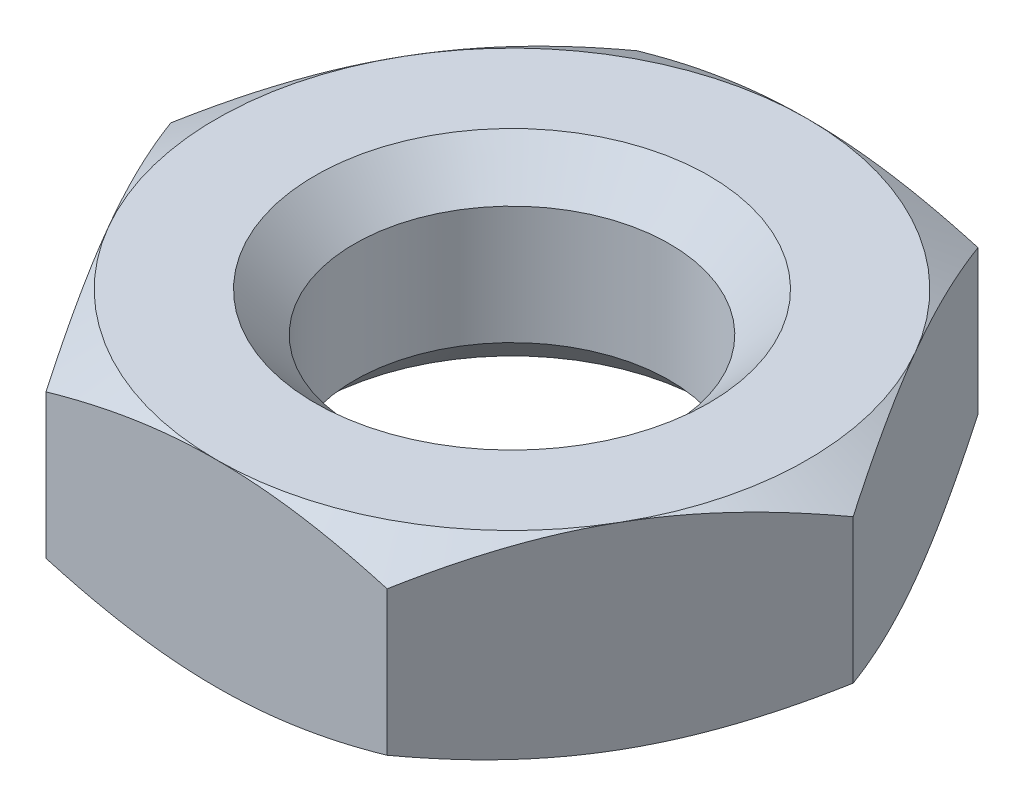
ISO-10303-21;
HEADER;
FILE_DESCRIPTION(('STEP AP214'),'2;1');
FILE_NAME('part.step','',(''),(''),'','','');
FILE_SCHEMA(('AUTOMOTIVE_DESIGN { 1 0 10303 214 1 1 1 1 }'));
ENDSEC;
DATA;
#1=APPLICATION_CONTEXT('core data for automotive mechanical design processes');
#2=APPLICATION_PROTOCOL_DEFINITION('international standard','automotive_design',2000,#1);
#3=PRODUCT_CONTEXT('',#1,'mechanical');
#4=PRODUCT('Part','Part','',(#3));
#5=PRODUCT_RELATED_PRODUCT_CATEGORY('part','',(#4));
#6=PRODUCT_DEFINITION_FORMATION('','',#4);
#7=PRODUCT_DEFINITION_CONTEXT('part definition',#1,'design');
#8=PRODUCT_DEFINITION('design','',#6,#7);
#9=PRODUCT_DEFINITION_SHAPE('','',#8);
#10=(LENGTH_UNIT() NAMED_UNIT(*) SI_UNIT(.MILLI.,.METRE.));
#11=(NAMED_UNIT(*) PLANE_ANGLE_UNIT() SI_UNIT($,.RADIAN.));
#12=(NAMED_UNIT(*) SI_UNIT($,.STERADIAN.) SOLID_ANGLE_UNIT());
#13=UNCERTAINTY_MEASURE_WITH_UNIT(LENGTH_MEASURE(1.E-05),#10,'distance_accuracy_value','');
#14=(GEOMETRIC_REPRESENTATION_CONTEXT(3) GLOBAL_UNCERTAINTY_ASSIGNED_CONTEXT((#13)) GLOBAL_UNIT_ASSIGNED_CONTEXT((#10,
#11,#12)) REPRESENTATION_CONTEXT('',''));
#15=CARTESIAN_POINT('',(0.,0.,0.));
#16=DIRECTION('',(0.,0.,1.));
#17=DIRECTION('',(1.,0.,0.));
#18=AXIS2_PLACEMENT_3D('',#15,#16,#17);
#19=CARTESIAN_POINT('',(0.,3.84768315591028,3.60822483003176E-13));
#20=DIRECTION('',(0.,-1.,0.));
#21=DIRECTION('',(0.999999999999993,0.,0.));
#22=AXIS2_PLACEMENT_3D('',#19,#20,#21);
#23=CONICAL_SURFACE('',#22,12.7279220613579,1.04719754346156);
#24=CARTESIAN_POINT('',(-10.3924203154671,5.19608574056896,0.000200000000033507));
#25=CARTESIAN_POINT('',(-10.2782163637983,5.26201798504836,-0.197607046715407));
#26=CARTESIAN_POINT('',(-10.1635669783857,5.32495857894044,-0.396185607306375));
#27=CARTESIAN_POINT('',(-9.93333715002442,5.44403099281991,-0.79495536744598));
#28=CARTESIAN_POINT('',(-9.81775632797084,5.50015987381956,-0.995147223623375));
#29=CARTESIAN_POINT('',(-9.5854491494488,5.60484803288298,-1.39751505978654));
#30=CARTESIAN_POINT('',(-9.46872073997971,5.65338922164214,-1.5996945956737));
#31=CARTESIAN_POINT('',(-9.23447001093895,5.7418514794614,-2.00542876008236));
#32=CARTESIAN_POINT('',(-9.1169478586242,5.78177430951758,-2.20898309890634));
#33=CARTESIAN_POINT('',(-8.88408932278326,5.85131532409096,-2.61230591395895));
#34=CARTESIAN_POINT('',(-8.76877013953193,5.88116249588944,-2.8120445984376));
#35=CARTESIAN_POINT('',(-8.53761578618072,5.93120668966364,-3.21241568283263));
#36=CARTESIAN_POINT('',(-8.4217806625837,5.95140456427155,-3.4130480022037));
#37=CARTESIAN_POINT('',(-8.18990949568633,5.9816456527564,-3.8146606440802));
#38=CARTESIAN_POINT('',(-8.07387383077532,5.99170039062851,-4.01564031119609));
#39=CARTESIAN_POINT('',(-7.8416957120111,6.00143766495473,-4.41778460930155));
#40=CARTESIAN_POINT('',(-7.72555326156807,6.00112052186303,-4.61894923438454));
#41=CARTESIAN_POINT('',(-7.50842141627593,5.99083604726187,-4.99503262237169));
#42=CARTESIAN_POINT('',(-7.40741671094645,5.98212325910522,-5.16997790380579));
#43=CARTESIAN_POINT('',(-7.20564388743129,5.95702265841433,-5.5194586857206));
#44=CARTESIAN_POINT('',(-7.10487578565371,5.94063432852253,-5.69399415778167));
#45=CARTESIAN_POINT('',(-6.80296158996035,5.88034344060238,-6.2169248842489));
#46=CARTESIAN_POINT('',(-6.60234990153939,5.82532251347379,-6.56439452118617));
#47=CARTESIAN_POINT('',(-6.19899850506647,5.68776951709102,-7.2630196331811));
#48=CARTESIAN_POINT('',(-5.99631027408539,5.60465437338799,-7.61408594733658));
#49=CARTESIAN_POINT('',(-5.59395639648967,5.41601744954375,-8.31098330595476));
#50=CARTESIAN_POINT('',(-5.3942855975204,5.31053997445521,-8.65682327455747));
#51=CARTESIAN_POINT('',(-5.19603695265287,5.19608574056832,-9.00019999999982));
#52=B_SPLINE_CURVE_WITH_KNOTS('',3,(#24,#25,#26,#27,#28,#29,#30,#31,#32,#33,#34,#35,#36,#37,#38,
#39,#40,#41,#42,#43,#44,#45,#46,#47,#48,#49,#50,#51),.UNSPECIFIED.,.F.,.F.,(4,2,2,2,2,2,2,2,2,2,
2,2,2,4),(0.,0.713219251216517,1.42674514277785,2.14194697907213,2.8570025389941,
3.55449750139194,4.25193082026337,4.94857086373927,5.64518938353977,6.25162977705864,
6.85811105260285,8.07193748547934,9.31268392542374,10.550994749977),.UNSPECIFIED.);
#53=CARTESIAN_POINT('',(-10.3923048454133,5.19615240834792,2.22044604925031E-13));
#54=VERTEX_POINT('',#53);
#55=CARTESIAN_POINT('',(-7.79422863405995,6.00000000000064,-4.49999999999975));
#56=VERTEX_POINT('',#55);
#57=EDGE_CURVE('E339',#54,#56,#52,.T.);
#58=ORIENTED_EDGE('',*,*,#57,.F.);
#59=CARTESIAN_POINT('',(-5.19603695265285,5.19608574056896,9.0001999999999));
#60=CARTESIAN_POINT('',(-5.31024090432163,5.26201798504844,8.80239295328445));
#61=CARTESIAN_POINT('',(-5.42489028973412,5.32495857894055,8.60381439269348));
#62=CARTESIAN_POINT('',(-5.6551201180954,5.44403099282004,8.20504463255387));
#63=CARTESIAN_POINT('',(-5.77070094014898,5.50015987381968,8.00485277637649));
#64=CARTESIAN_POINT('',(-6.00300811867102,5.60484803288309,7.60248494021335));
#65=CARTESIAN_POINT('',(-6.11973652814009,5.65338922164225,7.40030540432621));
#66=CARTESIAN_POINT('',(-6.35398725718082,5.7418514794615,6.99457123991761));
#67=CARTESIAN_POINT('',(-6.47150940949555,5.78177430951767,6.79101690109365));
#68=CARTESIAN_POINT('',(-6.70436794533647,5.85131532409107,6.38769408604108));
#69=CARTESIAN_POINT('',(-6.8196871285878,5.88116249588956,6.18795540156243));
#70=CARTESIAN_POINT('',(-7.050841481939,5.93120668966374,5.78758431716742));
#71=CARTESIAN_POINT('',(-7.16667660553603,5.95140456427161,5.58695199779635));
#72=CARTESIAN_POINT('',(-7.39854777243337,5.98164565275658,5.18533935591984));
#73=CARTESIAN_POINT('',(-7.51458343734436,5.99170039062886,4.98435968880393));
#74=CARTESIAN_POINT('',(-7.74676155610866,6.00143766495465,4.58221539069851));
#75=CARTESIAN_POINT('',(-7.86290400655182,6.00112052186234,4.38105076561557));
#76=CARTESIAN_POINT('',(-8.08003585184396,5.99083604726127,4.00496737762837));
#77=CARTESIAN_POINT('',(-8.18104055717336,5.98212325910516,3.83002209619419));
#78=CARTESIAN_POINT('',(-8.38281338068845,5.95702265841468,3.48054131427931));
#79=CARTESIAN_POINT('',(-8.48358148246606,5.94063432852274,3.30600584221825));
#80=CARTESIAN_POINT('',(-8.78549567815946,5.88034344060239,2.78307511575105));
#81=CARTESIAN_POINT('',(-8.98610736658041,5.82532251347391,2.43560547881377));
#82=CARTESIAN_POINT('',(-9.38945876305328,5.68776951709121,1.73698036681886));
#83=CARTESIAN_POINT('',(-9.59214699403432,5.60465437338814,1.38591405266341));
#84=CARTESIAN_POINT('',(-9.99450087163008,5.41601744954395,0.689016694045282));
#85=CARTESIAN_POINT('',(-10.1941716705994,5.31053997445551,0.343176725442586));
#86=CARTESIAN_POINT('',(-10.3924203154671,5.19608574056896,-0.000199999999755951));
#87=B_SPLINE_CURVE_WITH_KNOTS('',3,(#59,#60,#61,#62,#63,#64,#65,#66,#67,#68,#69,#70,#71,#72,#73,
#74,#75,#76,#77,#78,#79,#80,#81,#82,#83,#84,#85,#86),.UNSPECIFIED.,.F.,.F.,(4,2,2,2,2,2,2,2,2,2,
2,2,2,4),(0.,0.713219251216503,1.42674514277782,2.14194697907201,2.8570025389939,
3.55449750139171,4.25193082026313,4.94857086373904,5.64518938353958,6.2516297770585,
6.85811105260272,8.0719374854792,9.31268392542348,10.5509947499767),.UNSPECIFIED.);
#88=CARTESIAN_POINT('',(-7.79422863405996,6.00000000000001,4.50000000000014));
#89=VERTEX_POINT('',#88);
#90=EDGE_CURVE('E185',#89,#54,#87,.T.);
#91=ORIENTED_EDGE('',*,*,#90,.F.);
#92=CARTESIAN_POINT('',(0.,6.00000000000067,1.11022302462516E-13));
#93=DIRECTION('',(0.,1.,0.));
#94=DIRECTION('',(-0.999999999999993,0.,0.));
#95=AXIS2_PLACEMENT_3D('',#92,#93,#94);
#96=CIRCLE('',#95,9.);
#97=EDGE_CURVE('E267',#56,#89,#96,.T.);
#98=ORIENTED_EDGE('',*,*,#97,.F.);
#99=EDGE_LOOP('',(#58,#91,#98));
#100=FACE_BOUND('',#99,.T.);
#101=ADVANCED_FACE('F33',(#100),#23,.T.);
#102=CARTESIAN_POINT('',(-5.19615242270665,5.19615240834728,-8.99999999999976));
#103=VERTEX_POINT('',#102);
#104=EDGE_CURVE('E191',#56,#103,#52,.T.);
#105=ORIENTED_EDGE('',*,*,#104,.F.);
#106=CARTESIAN_POINT('',(0.,6.00000000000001,-8.99999999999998));
#107=VERTEX_POINT('',#106);
#108=EDGE_CURVE('E269',#107,#56,#96,.T.);
#109=ORIENTED_EDGE('',*,*,#108,.F.);
#110=CARTESIAN_POINT('',(-13.9688780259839,1.60223841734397,-8.99999999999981));
#111=CARTESIAN_POINT('',(-13.57570172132,1.79300989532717,-8.99999999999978));
#112=CARTESIAN_POINT('',(-13.1816241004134,1.98195550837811,-8.99999999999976));
#113=CARTESIAN_POINT('',(-12.3911869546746,2.3551683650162,-8.99999999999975));
#114=CARTESIAN_POINT('',(-11.9948270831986,2.53943487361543,-8.99999999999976));
#115=CARTESIAN_POINT('',(-11.1973093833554,2.90318751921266,-8.99999999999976));
#116=CARTESIAN_POINT('',(-10.7961371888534,3.08264226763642,-8.99999999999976));
#117=CARTESIAN_POINT('',(-9.99060617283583,3.43422338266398,-8.99999999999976));
#118=CARTESIAN_POINT('',(-9.58624750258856,3.60635009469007,-8.99999999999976));
#119=CARTESIAN_POINT('',(-8.76058646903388,3.94674726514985,-8.99999999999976));
#120=CARTESIAN_POINT('',(-8.33915829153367,4.11471423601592,-8.99999999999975));
#121=CARTESIAN_POINT('',(-7.49137667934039,4.43796341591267,-8.99999999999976));
#122=CARTESIAN_POINT('',(-7.06502269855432,4.59324420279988,-8.99999999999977));
#123=CARTESIAN_POINT('',(-6.20750042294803,4.88705236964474,-8.99999999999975));
#124=CARTESIAN_POINT('',(-5.77634384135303,5.02561356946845,-8.99999999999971));
#125=CARTESIAN_POINT('',(-4.90786122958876,5.28154557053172,-8.9999999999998));
#126=CARTESIAN_POINT('',(-4.47053718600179,5.39892303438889,-8.99999999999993));
#127=CARTESIAN_POINT('',(-3.59183822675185,5.60622692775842,-8.99999999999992));
#128=CARTESIAN_POINT('',(-3.15049964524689,5.69630321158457,-8.99999999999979));
#129=CARTESIAN_POINT('',(-2.48446356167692,5.80705020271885,-8.99999999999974));
#130=CARTESIAN_POINT('',(-2.26176385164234,5.83990612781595,-8.99999999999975));
#131=CARTESIAN_POINT('',(-1.8152536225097,5.89685130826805,-8.99999999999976));
#132=CARTESIAN_POINT('',(-1.59144321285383,5.92094141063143,-8.99999999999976));
#133=CARTESIAN_POINT('',(-1.14593987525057,5.95957231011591,-8.99999999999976));
#134=CARTESIAN_POINT('',(-0.924257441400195,5.97423365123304,-8.99999999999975));
#135=CARTESIAN_POINT('',(-0.480471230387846,5.99416817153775,-8.99999999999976));
#136=CARTESIAN_POINT('',(-0.258367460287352,5.99944150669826,-8.99999999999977));
#137=CARTESIAN_POINT('',(0.185864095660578,6.00047418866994,-8.99999999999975));
#138=CARTESIAN_POINT('',(0.407991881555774,5.99623351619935,-8.99999999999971));
#139=CARTESIAN_POINT('',(0.851870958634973,5.97834197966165,-8.9999999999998));
#140=CARTESIAN_POINT('',(1.07362223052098,5.96469064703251,-8.99999999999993));
#141=CARTESIAN_POINT('',(1.6062248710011,5.92089044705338,-8.99999999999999));
#142=CARTESIAN_POINT('',(1.91671830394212,5.88629500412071,-8.99999999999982));
#143=CARTESIAN_POINT('',(2.5353934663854,5.80053928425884,-8.9999999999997));
#144=CARTESIAN_POINT('',(2.84357487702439,5.74937676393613,-8.99999999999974));
#145=CARTESIAN_POINT('',(3.76430387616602,5.57375208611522,-8.9999999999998));
#146=CARTESIAN_POINT('',(4.37269044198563,5.42718500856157,-8.99999999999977));
#147=CARTESIAN_POINT('',(5.28237579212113,5.1731157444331,-8.99999999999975));
#148=CARTESIAN_POINT('',(5.58839577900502,5.08154603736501,-8.99999999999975));
#149=CARTESIAN_POINT('',(6.19746351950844,4.88891672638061,-8.99999999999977));
#150=CARTESIAN_POINT('',(6.5005112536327,4.78785706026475,-8.99999999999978));
#151=CARTESIAN_POINT('',(7.10372987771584,4.57786751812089,-8.99999999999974));
#152=CARTESIAN_POINT('',(7.40390168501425,4.46894025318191,-8.99999999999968));
#153=CARTESIAN_POINT('',(8.00176003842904,4.24449502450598,-8.99999999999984));
#154=CARTESIAN_POINT('',(8.29944661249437,4.12897713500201,-9.00000000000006));
#155=CARTESIAN_POINT('',(8.99706151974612,3.85079341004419,-9.00000000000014));
#156=CARTESIAN_POINT('',(9.3960796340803,3.68584932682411,-8.99999999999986));
#157=CARTESIAN_POINT('',(10.1907528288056,3.34802662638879,-8.99999999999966));
#158=CARTESIAN_POINT('',(10.5864077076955,3.17514753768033,-8.99999999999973));
#159=CARTESIAN_POINT('',(11.374973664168,2.82302947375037,-8.99999999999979));
#160=CARTESIAN_POINT('',(11.7678841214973,2.64378911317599,-8.99999999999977));
#161=CARTESIAN_POINT('',(12.5513279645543,2.2802197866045,-8.99999999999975));
#162=CARTESIAN_POINT('',(12.941861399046,2.09589092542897,-8.99999999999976));
#163=CARTESIAN_POINT('',(13.7213622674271,1.72288874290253,-8.99999999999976));
#164=CARTESIAN_POINT('',(14.1103275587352,1.53421095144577,-8.99999999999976));
#165=CARTESIAN_POINT('',(14.8865799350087,1.1534356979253,-8.99999999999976));
#166=CARTESIAN_POINT('',(15.2738670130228,0.961338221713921,-8.99999999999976));
#167=CARTESIAN_POINT('',(16.4335113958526,0.380867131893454,-8.99999999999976));
#168=CARTESIAN_POINT('',(17.2037525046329,-0.0117337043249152,-8.99999999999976));
#169=CARTESIAN_POINT('',(18.6763932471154,-0.771983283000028,-8.99999999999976));
#170=CARTESIAN_POINT('',(19.3791204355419,-1.13900036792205,-8.99999999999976));
#171=CARTESIAN_POINT('',(20.7819438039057,-1.87808361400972,-8.99999999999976));
#172=CARTESIAN_POINT('',(21.4820398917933,-2.25014994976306,-8.99999999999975));
#173=CARTESIAN_POINT('',(22.8784493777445,-2.99720909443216,-8.99999999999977));
#174=CARTESIAN_POINT('',(23.5747678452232,-3.37219244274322,-8.99999999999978));
#175=CARTESIAN_POINT('',(24.9657193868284,-4.12518299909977,-8.99999999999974));
#176=CARTESIAN_POINT('',(25.6603525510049,-4.50319004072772,-8.99999999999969));
#177=CARTESIAN_POINT('',(26.3543640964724,-4.88232724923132,-8.99999999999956));
#178=B_SPLINE_CURVE_WITH_KNOTS('',3,(#110,#111,#112,#113,#114,#115,#116,#117,#118,#119,#120,
#121,#122,#123,#124,#125,#126,#127,#128,#129,#130,#131,#132,#133,#134,#135,#136,#137,#138,#139,
#140,#141,#142,#143,#144,#145,#146,#147,#148,#149,#150,#151,#152,#153,#154,#155,#156,#157,#158,
#159,#160,#161,#162,#163,#164,#165,#166,#167,#168,#169,#170,#171,#172,#173,#174,#175,#176,#177),
.UNSPECIFIED.,.F.,.F.,(4,2,2,2,2,2,2,2,2,2,2,2,2,2,2,2,2,2,2,2,2,2,2,2,2,2,2,2,2,2,2,2,2,4),(0.,
1.31105838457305,2.62232145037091,3.94070430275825,5.25902494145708,6.61987030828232,
7.98086801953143,9.33906487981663,10.6968338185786,12.0470091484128,12.7221948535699,
13.3973153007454,14.0636232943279,14.7299202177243,15.396218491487,16.0625499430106,
16.9992652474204,17.9361074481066,19.8108290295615,20.7690285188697,21.7272342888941,
22.6851234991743,23.6430019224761,24.9381852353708,26.233445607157,27.5289898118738,
28.8245073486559,30.1214217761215,31.4183415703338,34.0118459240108,36.3902149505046,
38.7686664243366,41.1412619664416,43.513727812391),.UNSPECIFIED.);
#179=EDGE_CURVE('E204',#103,#107,#178,.T.);
#180=ORIENTED_EDGE('',*,*,#179,.F.);
#181=EDGE_LOOP('',(#105,#109,#180));
#182=FACE_BOUND('',#181,.T.);
#183=ADVANCED_FACE('F168',(#182),#23,.T.);
#184=CARTESIAN_POINT('',(5.19615242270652,5.19615240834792,-8.99999999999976));
#185=VERTEX_POINT('',#184);
#186=EDGE_CURVE('E198',#107,#185,#178,.T.);
#187=ORIENTED_EDGE('',*,*,#186,.F.);
#188=CARTESIAN_POINT('',(7.79422863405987,6.00000000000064,-4.50000000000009));
#189=VERTEX_POINT('',#188);
#190=EDGE_CURVE('E359',#189,#107,#96,.T.);
#191=ORIENTED_EDGE('',*,*,#190,.F.);
#192=CARTESIAN_POINT('',(5.19603695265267,5.19608574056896,-9.00019999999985));
#193=CARTESIAN_POINT('',(5.31024090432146,5.26201798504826,-8.80239295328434));
#194=CARTESIAN_POINT('',(5.42489028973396,5.32495857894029,-8.60381439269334));
#195=CARTESIAN_POINT('',(5.65512011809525,5.44403099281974,-8.20504463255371));
#196=CARTESIAN_POINT('',(5.77070094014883,5.50015987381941,-8.00485277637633));
#197=CARTESIAN_POINT('',(6.00300811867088,5.60484803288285,-7.60248494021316));
#198=CARTESIAN_POINT('',(6.11973652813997,5.65338922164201,-7.400305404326));
#199=CARTESIAN_POINT('',(6.35398725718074,5.74185147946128,-6.99457123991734));
#200=CARTESIAN_POINT('',(6.47150940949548,5.78177430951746,-6.79101690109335));
#201=CARTESIAN_POINT('',(6.70436794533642,5.85131532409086,-6.38769408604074));
#202=CARTESIAN_POINT('',(6.81968712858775,5.88116249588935,-6.18795540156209));
#203=CARTESIAN_POINT('',(7.05084148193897,5.93120668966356,-5.78758431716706));
#204=CARTESIAN_POINT('',(7.166676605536,5.95140456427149,-5.58695199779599));
#205=CARTESIAN_POINT('',(7.39854777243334,5.98164565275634,-5.18533935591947));
#206=CARTESIAN_POINT('',(7.51458343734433,5.99170039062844,-4.98435968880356));
#207=CARTESIAN_POINT('',(7.74676155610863,6.00143766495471,-4.58221539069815));
#208=CARTESIAN_POINT('',(7.86290400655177,6.00112052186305,-4.38105076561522));
#209=CARTESIAN_POINT('',(8.08003585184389,5.9908360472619,-4.00496737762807));
#210=CARTESIAN_POINT('',(8.18104055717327,5.98212325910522,-3.83002209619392));
#211=CARTESIAN_POINT('',(8.38281338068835,5.95702265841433,-3.48054131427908));
#212=CARTESIAN_POINT('',(8.48358148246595,5.94063432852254,-3.30600584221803));
#213=CARTESIAN_POINT('',(8.78549567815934,5.88034344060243,-2.78307511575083));
#214=CARTESIAN_POINT('',(8.98610736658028,5.82532251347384,-2.43560547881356));
#215=CARTESIAN_POINT('',(9.38945876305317,5.6877695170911,-1.73698036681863));
#216=CARTESIAN_POINT('',(9.59214699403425,5.6046543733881,-1.38591405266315));
#217=CARTESIAN_POINT('',(9.99450087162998,5.41601744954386,-0.689016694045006));
#218=CARTESIAN_POINT('',(10.1941716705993,5.31053997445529,-0.343176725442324));
#219=CARTESIAN_POINT('',(10.3924203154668,5.19608574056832,0.000199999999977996));
#220=B_SPLINE_CURVE_WITH_KNOTS('',3,(#192,#193,#194,#195,#196,#197,#198,#199,#200,#201,#202,
#203,#204,#205,#206,#207,#208,#209,#210,#211,#212,#213,#214,#215,#216,#217,#218,#219),
.UNSPECIFIED.,.F.,.F.,(4,2,2,2,2,2,2,2,2,2,2,2,2,4),(0.,0.713219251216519,1.42674514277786,
2.14194697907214,2.85700253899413,3.55449750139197,4.25193082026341,4.94857086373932,
5.64518938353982,6.25162977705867,6.85811105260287,8.07193748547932,9.31268392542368,
10.5509947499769),.UNSPECIFIED.);
#221=EDGE_CURVE('E260',#185,#189,#220,.T.);
#222=ORIENTED_EDGE('',*,*,#221,.F.);
#223=EDGE_LOOP('',(#187,#191,#222));
#224=FACE_BOUND('',#223,.T.);
#225=ADVANCED_FACE('F360',(#224),#23,.T.);
#226=CARTESIAN_POINT('',(-5.19615242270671,5.19615240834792,8.99999999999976));
#227=VERTEX_POINT('',#226);
#228=EDGE_CURVE('E233',#227,#89,#87,.T.);
#229=ORIENTED_EDGE('',*,*,#228,.F.);
#230=CARTESIAN_POINT('',(-13.9688780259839,1.60223841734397,8.99999999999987));
#231=CARTESIAN_POINT('',(-13.57570172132,1.79300989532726,8.99999999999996));
#232=CARTESIAN_POINT('',(-13.1816241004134,1.98195550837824,8.99999999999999));
#233=CARTESIAN_POINT('',(-12.3911869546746,2.35516836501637,9.00000000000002));
#234=CARTESIAN_POINT('',(-11.9948270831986,2.5394348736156,9.00000000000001));
#235=CARTESIAN_POINT('',(-11.1973093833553,2.90318751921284,9.00000000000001));
#236=CARTESIAN_POINT('',(-10.7961371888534,3.08264226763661,9.00000000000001));
#237=CARTESIAN_POINT('',(-9.99060617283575,3.4342233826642,9.00000000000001));
#238=CARTESIAN_POINT('',(-9.58624750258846,3.6063500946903,9.00000000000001));
#239=CARTESIAN_POINT('',(-8.76058646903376,3.94674726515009,9.00000000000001));
#240=CARTESIAN_POINT('',(-8.33915829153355,4.11471423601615,9.00000000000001));
#241=CARTESIAN_POINT('',(-7.49137667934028,4.43796341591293,9.00000000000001));
#242=CARTESIAN_POINT('',(-7.0650226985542,4.59324420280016,9.00000000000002));
#243=CARTESIAN_POINT('',(-6.2075004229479,4.88705236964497,8.99999999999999));
#244=CARTESIAN_POINT('',(-5.77634384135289,5.02561356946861,8.99999999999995));
#245=CARTESIAN_POINT('',(-4.90786122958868,5.2815455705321,9.00000000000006));
#246=CARTESIAN_POINT('',(-4.4705371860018,5.39892303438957,9.00000000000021));
#247=CARTESIAN_POINT('',(-3.5918382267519,5.60622692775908,9.0000000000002));
#248=CARTESIAN_POINT('',(-3.15049964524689,5.69630321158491,9.00000000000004));
#249=CARTESIAN_POINT('',(-2.48446356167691,5.80705020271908,8.99999999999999));
#250=CARTESIAN_POINT('',(-2.26176385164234,5.8399061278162,9.));
#251=CARTESIAN_POINT('',(-1.81525362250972,5.89685130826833,9.00000000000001));
#252=CARTESIAN_POINT('',(-1.59144321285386,5.92094141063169,9.00000000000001));
#253=CARTESIAN_POINT('',(-1.14593987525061,5.95957231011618,9.00000000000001));
#254=CARTESIAN_POINT('',(-0.924257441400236,5.97423365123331,9.00000000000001));
#255=CARTESIAN_POINT('',(-0.480471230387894,5.99416817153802,9.00000000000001));
#256=CARTESIAN_POINT('',(-0.258367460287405,5.99944150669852,9.));
#257=CARTESIAN_POINT('',(0.185864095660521,6.00047418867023,9.00000000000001));
#258=CARTESIAN_POINT('',(0.407991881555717,5.99623351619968,9.00000000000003));
#259=CARTESIAN_POINT('',(0.851870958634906,5.97834197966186,8.99999999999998));
#260=CARTESIAN_POINT('',(1.07362223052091,5.96469064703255,8.99999999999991));
#261=CARTESIAN_POINT('',(1.60622487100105,5.92089044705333,8.99999999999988));
#262=CARTESIAN_POINT('',(1.91671830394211,5.88629500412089,8.99999999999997));
#263=CARTESIAN_POINT('',(2.53539346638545,5.80053928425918,9.00000000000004));
#264=CARTESIAN_POINT('',(2.84357487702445,5.74937676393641,9.00000000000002));
#265=CARTESIAN_POINT('',(3.76430387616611,5.57375208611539,8.99999999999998));
#266=CARTESIAN_POINT('',(4.37269044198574,5.42718500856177,9.00000000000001));
#267=CARTESIAN_POINT('',(5.28237579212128,5.17311574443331,9.00000000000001));
#268=CARTESIAN_POINT('',(5.58839577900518,5.08154603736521,9.00000000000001));
#269=CARTESIAN_POINT('',(6.1974635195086,4.88891672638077,9.00000000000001));
#270=CARTESIAN_POINT('',(6.50051125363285,4.78785706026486,9.00000000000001));
#271=CARTESIAN_POINT('',(7.10372987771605,4.57786751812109,9.00000000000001));
#272=CARTESIAN_POINT('',(7.40390168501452,4.46894025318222,8.99999999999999));
#273=CARTESIAN_POINT('',(8.0017600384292,4.24449502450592,9.00000000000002));
#274=CARTESIAN_POINT('',(8.29944661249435,4.12897713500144,9.00000000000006));
#275=CARTESIAN_POINT('',(8.99706151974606,3.8507934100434,9.00000000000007));
#276=CARTESIAN_POINT('',(9.3960796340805,3.68584932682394,9.00000000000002));
#277=CARTESIAN_POINT('',(10.190752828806,3.34802662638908,8.99999999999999));
#278=CARTESIAN_POINT('',(10.5864077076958,3.17514753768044,9.));
#279=CARTESIAN_POINT('',(11.3749736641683,2.82302947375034,9.00000000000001));
#280=CARTESIAN_POINT('',(11.7678841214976,2.643789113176,9.00000000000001));
#281=CARTESIAN_POINT('',(12.5513279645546,2.28021978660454,9.00000000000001));
#282=CARTESIAN_POINT('',(12.9418613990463,2.095890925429,9.00000000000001));
#283=CARTESIAN_POINT('',(13.7213622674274,1.72288874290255,9.00000000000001));
#284=CARTESIAN_POINT('',(14.1103275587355,1.5342109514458,9.00000000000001));
#285=CARTESIAN_POINT('',(14.8865799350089,1.15343569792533,9.00000000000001));
#286=CARTESIAN_POINT('',(15.273867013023,0.961338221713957,9.00000000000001));
#287=CARTESIAN_POINT('',(16.4335113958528,0.380867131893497,9.00000000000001));
#288=CARTESIAN_POINT('',(17.2037525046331,-0.0117337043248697,9.00000000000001));
#289=CARTESIAN_POINT('',(18.6763932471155,-0.771983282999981,9.00000000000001));
#290=CARTESIAN_POINT('',(19.379120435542,-1.139000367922,9.00000000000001));
#291=CARTESIAN_POINT('',(20.7819438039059,-1.87808361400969,9.00000000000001));
#292=CARTESIAN_POINT('',(21.4820398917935,-2.25014994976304,9.00000000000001));
#293=CARTESIAN_POINT('',(22.8784493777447,-2.99720909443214,9.));
#294=CARTESIAN_POINT('',(23.5747678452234,-3.37219244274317,8.99999999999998));
#295=CARTESIAN_POINT('',(24.9657193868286,-4.12518299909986,9.00000000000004));
#296=CARTESIAN_POINT('',(25.660352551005,-4.50319004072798,9.00000000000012));
#297=CARTESIAN_POINT('',(26.3543640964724,-4.88232724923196,9.00000000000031));
#298=B_SPLINE_CURVE_WITH_KNOTS('',3,(#230,#231,#232,#233,#234,#235,#236,#237,#238,#239,#240,
#241,#242,#243,#244,#245,#246,#247,#248,#249,#250,#251,#252,#253,#254,#255,#256,#257,#258,#259,
#260,#261,#262,#263,#264,#265,#266,#267,#268,#269,#270,#271,#272,#273,#274,#275,#276,#277,#278,
#279,#280,#281,#282,#283,#284,#285,#286,#287,#288,#289,#290,#291,#292,#293,#294,#295,#296,#297),
.UNSPECIFIED.,.F.,.F.,(4,2,2,2,2,2,2,2,2,2,2,2,2,2,2,2,2,2,2,2,2,2,2,2,2,2,2,2,2,2,2,2,2,4),(0.,
1.31105838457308,2.62232145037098,3.94070430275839,5.25902494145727,6.61987030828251,
7.98086801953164,9.33906487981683,10.6968338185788,12.0470091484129,12.72219485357,
13.3973153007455,14.0636232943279,14.7299202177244,15.3962184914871,16.0625499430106,
16.9992652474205,17.9361074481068,19.8108290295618,20.76902851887,21.7272342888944,
22.6851234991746,23.6430019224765,24.9381852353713,26.2334456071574,27.5289898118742,
28.8245073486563,30.1214217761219,31.4183415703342,34.0118459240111,36.3902149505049,
38.7686664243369,41.141261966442,43.5137278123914),.UNSPECIFIED.);
#299=CARTESIAN_POINT('',(0.,6.00000000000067,9.00000000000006));
#300=VERTEX_POINT('',#299);
#301=EDGE_CURVE('E143',#300,#227,#298,.F.);
#302=ORIENTED_EDGE('',*,*,#301,.F.);
#303=EDGE_CURVE('E271',#89,#300,#96,.T.);
#304=ORIENTED_EDGE('',*,*,#303,.F.);
#305=EDGE_LOOP('',(#229,#302,#304));
#306=FACE_BOUND('',#305,.T.);
#307=ADVANCED_FACE('F363',(#306),#23,.T.);
#308=CARTESIAN_POINT('',(10.3923048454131,5.19615240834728,2.4980018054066E-13));
#309=VERTEX_POINT('',#308);
#310=EDGE_CURVE('E273',#189,#309,#220,.T.);
#311=ORIENTED_EDGE('',*,*,#310,.F.);
#312=CARTESIAN_POINT('',(7.79422863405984,6.00000000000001,4.50000000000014));
#313=VERTEX_POINT('',#312);
#314=EDGE_CURVE('E358',#313,#189,#96,.T.);
#315=ORIENTED_EDGE('',*,*,#314,.F.);
#316=CARTESIAN_POINT('',(10.3924203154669,5.19608574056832,-0.000200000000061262));
#317=CARTESIAN_POINT('',(10.2782163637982,5.26201798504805,0.197607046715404));
#318=CARTESIAN_POINT('',(10.1635669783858,5.32495857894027,0.396185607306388));
#319=CARTESIAN_POINT('',(9.93333715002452,5.44403099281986,0.794955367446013));
#320=CARTESIAN_POINT('',(9.81775632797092,5.50015987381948,0.995147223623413));
#321=CARTESIAN_POINT('',(9.58544914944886,5.60484803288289,1.39751505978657));
#322=CARTESIAN_POINT('',(9.46872073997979,5.65338922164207,1.59969459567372));
#323=CARTESIAN_POINT('',(9.23447001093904,5.74185147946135,2.00542876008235));
#324=CARTESIAN_POINT('',(9.1169478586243,5.78177430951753,2.20898309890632));
#325=CARTESIAN_POINT('',(8.88408932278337,5.85131532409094,2.61230591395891));
#326=CARTESIAN_POINT('',(8.76877013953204,5.88116249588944,2.81204459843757));
#327=CARTESIAN_POINT('',(8.53761578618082,5.93120668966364,3.2124156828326));
#328=CARTESIAN_POINT('',(8.42178066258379,5.95140456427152,3.41304800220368));
#329=CARTESIAN_POINT('',(8.18990949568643,5.9816456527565,3.8146606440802));
#330=CARTESIAN_POINT('',(8.07387383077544,5.99170039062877,4.01564031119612));
#331=CARTESIAN_POINT('',(7.84169571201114,6.00143766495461,4.41778460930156));
#332=CARTESIAN_POINT('',(7.72555326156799,6.00112052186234,4.61894923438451));
#333=CARTESIAN_POINT('',(7.50842141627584,5.99083604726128,4.99503262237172));
#334=CARTESIAN_POINT('',(7.40741671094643,5.98212325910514,5.1699779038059));
#335=CARTESIAN_POINT('',(7.20564388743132,5.95702265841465,5.51945868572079));
#336=CARTESIAN_POINT('',(7.10487578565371,5.94063432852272,5.69399415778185));
#337=CARTESIAN_POINT('',(6.8029615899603,5.8803434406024,6.21692488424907));
#338=CARTESIAN_POINT('',(6.60234990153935,5.82532251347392,6.56439452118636));
#339=CARTESIAN_POINT('',(6.19899850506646,5.68776951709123,7.2630196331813));
#340=CARTESIAN_POINT('',(5.99631027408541,5.60465437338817,7.61408594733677));
#341=CARTESIAN_POINT('',(5.59395639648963,5.41601744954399,8.31098330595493));
#342=CARTESIAN_POINT('',(5.39428559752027,5.31053997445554,8.65682327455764));
#343=CARTESIAN_POINT('',(5.19603695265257,5.19608574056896,9.00019999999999));
#344=B_SPLINE_CURVE_WITH_KNOTS('',3,(#316,#317,#318,#319,#320,#321,#322,#323,#324,#325,#326,
#327,#328,#329,#330,#331,#332,#333,#334,#335,#336,#337,#338,#339,#340,#341,#342,#343),
.UNSPECIFIED.,.F.,.F.,(4,2,2,2,2,2,2,2,2,2,2,2,2,4),(0.,0.713219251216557,1.42674514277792,
2.14194697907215,2.85700253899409,3.55449750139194,4.25193082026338,4.94857086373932,
5.6451893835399,6.25162977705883,6.85811105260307,8.07193748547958,9.31268392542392,
10.5509947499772),.UNSPECIFIED.);
#345=EDGE_CURVE('E48',#309,#313,#344,.T.);
#346=ORIENTED_EDGE('',*,*,#345,.F.);
#347=EDGE_LOOP('',(#311,#315,#346));
#348=FACE_BOUND('',#347,.T.);
#349=ADVANCED_FACE('F356',(#348),#23,.T.);
#350=CARTESIAN_POINT('',(5.19615242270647,5.19615240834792,9.00000000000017));
#351=VERTEX_POINT('',#350);
#352=EDGE_CURVE('E131',#351,#300,#298,.F.);
#353=ORIENTED_EDGE('',*,*,#352,.F.);
#354=EDGE_CURVE('E120',#313,#351,#344,.T.);
#355=ORIENTED_EDGE('',*,*,#354,.F.);
#356=EDGE_CURVE('E140',#300,#313,#96,.T.);
#357=ORIENTED_EDGE('',*,*,#356,.F.);
#358=EDGE_LOOP('',(#353,#355,#357));
#359=FACE_BOUND('',#358,.T.);
#360=ADVANCED_FACE('F138',(#359),#23,.T.);
#361=CARTESIAN_POINT('',(0.,6.66133814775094E-13,3.60822483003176E-13));
#362=DIRECTION('',(0.,1.,0.));
#363=DIRECTION('',(-0.999999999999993,0.,0.));
#364=AXIS2_PLACEMENT_3D('',#361,#362,#363);
#365=CONICAL_SURFACE('',#364,9.,1.04719754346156);
#366=CARTESIAN_POINT('',(10.3924203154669,0.803914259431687,0.000200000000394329));
#367=CARTESIAN_POINT('',(10.2782163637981,0.73798201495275,-0.197607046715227));
#368=CARTESIAN_POINT('',(10.1635669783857,0.675041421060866,-0.396185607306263));
#369=CARTESIAN_POINT('',(9.93333715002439,0.555969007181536,-0.794955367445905));
#370=CARTESIAN_POINT('',(9.81775632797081,0.49984012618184,-0.995147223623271));
#371=CARTESIAN_POINT('',(9.58544914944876,0.395151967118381,-1.39751505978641));
#372=CARTESIAN_POINT('',(9.46872073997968,0.346610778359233,-1.59969459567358));
#373=CARTESIAN_POINT('',(9.23447001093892,0.25814852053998,-2.00542876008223));
#374=CARTESIAN_POINT('',(9.11694785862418,0.218225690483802,-2.20898309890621));
#375=CARTESIAN_POINT('',(8.88408932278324,0.14868467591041,-2.61230591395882));
#376=CARTESIAN_POINT('',(8.76877013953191,0.118837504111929,-2.81204459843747));
#377=CARTESIAN_POINT('',(8.53761578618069,0.0687933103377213,-3.21241568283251));
#378=CARTESIAN_POINT('',(8.42178066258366,0.0485954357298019,-3.41304800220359));
#379=CARTESIAN_POINT('',(8.1899094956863,0.0183543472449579,-3.81466064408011));
#380=CARTESIAN_POINT('',(8.0738738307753,0.00829960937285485,-4.01564031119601));
#381=CARTESIAN_POINT('',(7.84169571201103,-0.0014376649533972,-4.41778460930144));
#382=CARTESIAN_POINT('',(7.72555326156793,-0.00112052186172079,-4.6189492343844));
#383=CARTESIAN_POINT('',(7.50842141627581,0.00916395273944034,-4.99503262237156));
#384=CARTESIAN_POINT('',(7.40741671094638,0.0178767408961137,-5.16997790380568));
#385=CARTESIAN_POINT('',(7.20564388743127,0.0429773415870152,-5.51945868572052));
#386=CARTESIAN_POINT('',(7.10487578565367,0.0593656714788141,-5.69399415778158));
#387=CARTESIAN_POINT('',(6.80296158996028,0.11965655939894,-6.21692488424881));
#388=CARTESIAN_POINT('',(6.60234990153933,0.174677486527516,-6.56439452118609));
#389=CARTESIAN_POINT('',(6.19899850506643,0.312230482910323,-7.26301963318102));
#390=CARTESIAN_POINT('',(5.99631027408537,0.395345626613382,-7.61408594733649));
#391=CARTESIAN_POINT('',(5.59395639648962,0.583982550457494,-8.31098330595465));
#392=CARTESIAN_POINT('',(5.39428559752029,0.689460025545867,-8.65682327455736));
#393=CARTESIAN_POINT('',(5.19603695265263,0.803914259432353,-9.00019999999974));
#394=B_SPLINE_CURVE_WITH_KNOTS('',3,(#366,#367,#368,#369,#370,#371,#372,#373,#374,#375,#376,
#377,#378,#379,#380,#381,#382,#383,#384,#385,#386,#387,#388,#389,#390,#391,#392,#393),
.UNSPECIFIED.,.F.,.F.,(4,2,2,2,2,2,2,2,2,2,2,2,2,4),(0.,0.713219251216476,1.42674514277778,
2.14194697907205,2.85700253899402,3.55449750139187,4.25193082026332,4.94857086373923,
5.64518938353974,6.25162977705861,6.85811105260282,8.07193748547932,9.31268392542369,
10.5509947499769),.UNSPECIFIED.);
#395=CARTESIAN_POINT('',(10.3923048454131,0.803847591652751,2.77555756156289E-13));
#396=VERTEX_POINT('',#395);
#397=CARTESIAN_POINT('',(7.79422863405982,6.66133814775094E-13,-4.4999999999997));
#398=VERTEX_POINT('',#397);
#399=EDGE_CURVE('E350',#396,#398,#394,.T.);
#400=ORIENTED_EDGE('',*,*,#399,.F.);
#401=CARTESIAN_POINT('',(5.1960369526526,0.803914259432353,9.00020000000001));
#402=CARTESIAN_POINT('',(5.31024090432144,0.737982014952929,8.80239295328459));
#403=CARTESIAN_POINT('',(5.42489028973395,0.675041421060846,8.60381439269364));
#404=CARTESIAN_POINT('',(5.65512011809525,0.555969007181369,8.20504463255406));
#405=CARTESIAN_POINT('',(5.77070094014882,0.499840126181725,8.00485277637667));
#406=CARTESIAN_POINT('',(6.00300811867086,0.395151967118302,7.60248494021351));
#407=CARTESIAN_POINT('',(6.11973652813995,0.346610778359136,7.40030540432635));
#408=CARTESIAN_POINT('',(6.35398725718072,0.258148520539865,6.99457123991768));
#409=CARTESIAN_POINT('',(6.47150940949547,0.218225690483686,6.79101690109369));
#410=CARTESIAN_POINT('',(6.70436794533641,0.148684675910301,6.38769408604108));
#411=CARTESIAN_POINT('',(6.81968712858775,0.118837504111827,6.18795540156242));
#412=CARTESIAN_POINT('',(7.05084148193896,0.068793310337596,5.7875843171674));
#413=CARTESIAN_POINT('',(7.16667660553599,0.0485954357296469,5.58695199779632));
#414=CARTESIAN_POINT('',(7.39854777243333,0.018354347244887,5.18533935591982));
#415=CARTESIAN_POINT('',(7.51458343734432,0.00829960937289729,4.98435968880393));
#416=CARTESIAN_POINT('',(7.74676155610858,-0.00143766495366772,4.58221539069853));
#417=CARTESIAN_POINT('',(7.86290400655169,-0.00112052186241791,4.38105076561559));
#418=CARTESIAN_POINT('',(8.0800358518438,0.00916395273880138,4.00496737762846));
#419=CARTESIAN_POINT('',(8.1810405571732,0.017876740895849,3.83002209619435));
#420=CARTESIAN_POINT('',(8.38281338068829,0.0429773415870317,3.48054131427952));
#421=CARTESIAN_POINT('',(8.4835814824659,0.059365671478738,3.30600584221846));
#422=CARTESIAN_POINT('',(8.78549567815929,0.119656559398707,2.78307511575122));
#423=CARTESIAN_POINT('',(8.98610736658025,0.174677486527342,2.43560547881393));
#424=CARTESIAN_POINT('',(9.38945876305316,0.312230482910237,1.73698036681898));
#425=CARTESIAN_POINT('',(9.59214699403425,0.395345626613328,1.3859140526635));
#426=CARTESIAN_POINT('',(9.99450087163,0.583982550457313,0.689016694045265));
#427=CARTESIAN_POINT('',(10.1941716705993,0.689460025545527,0.343176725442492));
#428=CARTESIAN_POINT('',(10.3924203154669,0.803914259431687,-0.000200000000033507));
#429=B_SPLINE_CURVE_WITH_KNOTS('',3,(#401,#402,#403,#404,#405,#406,#407,#408,#409,#410,#411,
#412,#413,#414,#415,#416,#417,#418,#419,#420,#421,#422,#423,#424,#425,#426,#427,#428),
.UNSPECIFIED.,.F.,.F.,(4,2,2,2,2,2,2,2,2,2,2,2,2,4),(0.,0.713219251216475,1.42674514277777,
2.14194697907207,2.85700253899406,3.55449750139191,4.25193082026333,4.94857086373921,
5.64518938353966,6.2516297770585,6.85811105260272,8.07193748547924,9.31268392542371,
10.5509947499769),.UNSPECIFIED.);
#430=CARTESIAN_POINT('',(7.79422863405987,0.,4.50000000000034));
#431=VERTEX_POINT('',#430);
#432=EDGE_CURVE('E314',#431,#396,#429,.T.);
#433=ORIENTED_EDGE('',*,*,#432,.F.);
#434=CARTESIAN_POINT('',(0.,6.66133814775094E-13,3.60822483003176E-13));
#435=DIRECTION('',(0.,1.,0.));
#436=DIRECTION('',(-0.999999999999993,0.,0.));
#437=AXIS2_PLACEMENT_3D('',#434,#435,#436);
#438=CIRCLE('',#437,9.);
#439=EDGE_CURVE('E272',#431,#398,#438,.T.);
#440=ORIENTED_EDGE('',*,*,#439,.T.);
#441=EDGE_LOOP('',(#400,#433,#440));
#442=FACE_BOUND('',#441,.T.);
#443=ADVANCED_FACE('F170',(#442),#365,.T.);
#444=CARTESIAN_POINT('',(5.19615242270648,0.803847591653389,-8.99999999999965));
#445=VERTEX_POINT('',#444);
#446=EDGE_CURVE('E210',#398,#445,#394,.T.);
#447=ORIENTED_EDGE('',*,*,#446,.F.);
#448=CARTESIAN_POINT('',(-1.11022302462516E-13,0.,-8.99999999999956));
#449=VERTEX_POINT('',#448);
#450=EDGE_CURVE('E338',#398,#449,#438,.T.);
#451=ORIENTED_EDGE('',*,*,#450,.T.);
#452=CARTESIAN_POINT('',(-13.9688780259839,4.39776158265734,-8.99999999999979));
#453=CARTESIAN_POINT('',(-13.5757017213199,4.20699010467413,-8.99999999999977));
#454=CARTESIAN_POINT('',(-13.1816241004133,4.01804449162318,-8.99999999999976));
#455=CARTESIAN_POINT('',(-12.3911869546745,3.64483163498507,-8.99999999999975));
#456=CARTESIAN_POINT('',(-11.9948270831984,3.46056512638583,-8.99999999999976));
#457=CARTESIAN_POINT('',(-11.1973093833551,3.09681248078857,-8.99999999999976));
#458=CARTESIAN_POINT('',(-10.7961371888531,2.91735773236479,-8.99999999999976));
#459=CARTESIAN_POINT('',(-9.99060617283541,2.56577661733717,-8.99999999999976));
#460=CARTESIAN_POINT('',(-9.58624750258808,2.39364990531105,-8.99999999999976));
#461=CARTESIAN_POINT('',(-8.76058646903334,2.05325273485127,-8.99999999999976));
#462=CARTESIAN_POINT('',(-8.33915829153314,1.88528576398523,-8.99999999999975));
#463=CARTESIAN_POINT('',(-7.49137667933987,1.56203658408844,-8.99999999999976));
#464=CARTESIAN_POINT('',(-7.0650226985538,1.40675579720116,-8.99999999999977));
#465=CARTESIAN_POINT('',(-6.20750042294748,1.1129476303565,-8.99999999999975));
#466=CARTESIAN_POINT('',(-5.77634384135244,0.974386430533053,-8.99999999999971));
#467=CARTESIAN_POINT('',(-4.90786122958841,0.718454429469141,-8.9999999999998));
#468=CARTESIAN_POINT('',(-4.47053718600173,0.601076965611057,-8.99999999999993));
#469=CARTESIAN_POINT('',(-3.5918382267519,0.393773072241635,-8.99999999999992));
#470=CARTESIAN_POINT('',(-3.15049964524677,0.303696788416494,-8.99999999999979));
#471=CARTESIAN_POINT('',(-2.48446356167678,0.192949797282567,-8.99999999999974));
#472=CARTESIAN_POINT('',(-2.26176385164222,0.160093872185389,-8.99999999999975));
#473=CARTESIAN_POINT('',(-1.81525362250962,0.103148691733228,-8.99999999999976));
#474=CARTESIAN_POINT('',(-1.59144321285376,0.0790585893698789,-8.99999999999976));
#475=CARTESIAN_POINT('',(-1.14593987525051,0.0404276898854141,-8.99999999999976));
#476=CARTESIAN_POINT('',(-0.924257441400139,0.0257663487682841,-8.99999999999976));
#477=CARTESIAN_POINT('',(-0.480471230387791,0.00583182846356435,-8.99999999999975));
#478=CARTESIAN_POINT('',(-0.258367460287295,0.000558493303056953,-8.99999999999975));
#479=CARTESIAN_POINT('',(0.185864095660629,-0.000474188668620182,-8.99999999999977));
#480=CARTESIAN_POINT('',(0.407991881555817,0.00376648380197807,-8.9999999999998));
#481=CARTESIAN_POINT('',(0.851870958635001,0.0216580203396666,-8.99999999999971));
#482=CARTESIAN_POINT('',(1.073622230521,0.0353093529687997,-8.99999999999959));
#483=CARTESIAN_POINT('',(1.60622487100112,0.0791095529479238,-8.99999999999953));
#484=CARTESIAN_POINT('',(1.91671830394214,0.113704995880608,-8.9999999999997));
#485=CARTESIAN_POINT('',(2.53539346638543,0.199460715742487,-8.99999999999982));
#486=CARTESIAN_POINT('',(2.84357487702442,0.250623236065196,-8.99999999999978));
#487=CARTESIAN_POINT('',(3.76430387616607,0.426247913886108,-8.99999999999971));
#488=CARTESIAN_POINT('',(4.3726904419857,0.572814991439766,-8.99999999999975));
#489=CARTESIAN_POINT('',(5.28237579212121,0.82688425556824,-8.99999999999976));
#490=CARTESIAN_POINT('',(5.58839577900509,0.918453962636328,-8.99999999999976));
#491=CARTESIAN_POINT('',(6.19746351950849,1.11108327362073,-8.99999999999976));
#492=CARTESIAN_POINT('',(6.50051125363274,1.21214293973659,-8.99999999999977));
#493=CARTESIAN_POINT('',(7.10372987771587,1.42213248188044,-8.99999999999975));
#494=CARTESIAN_POINT('',(7.40390168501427,1.53105974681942,-8.99999999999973));
#495=CARTESIAN_POINT('',(8.00176003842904,1.75550497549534,-8.99999999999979));
#496=CARTESIAN_POINT('',(8.29944661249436,1.8710228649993,-8.99999999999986));
#497=CARTESIAN_POINT('',(8.99706151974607,2.1492065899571,-8.99999999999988));
#498=CARTESIAN_POINT('',(9.39607963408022,2.31415067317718,-8.99999999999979));
#499=CARTESIAN_POINT('',(10.1907528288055,2.65197337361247,-8.99999999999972));
#500=CARTESIAN_POINT('',(10.5864077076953,2.82485246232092,-8.99999999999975));
#501=CARTESIAN_POINT('',(11.3749736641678,3.17697052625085,-8.99999999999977));
#502=CARTESIAN_POINT('',(11.7678841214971,3.35621088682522,-8.99999999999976));
#503=CARTESIAN_POINT('',(12.551327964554,3.71978021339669,-8.99999999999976));
#504=CARTESIAN_POINT('',(12.9418613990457,3.9041090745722,-8.99999999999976));
#505=CARTESIAN_POINT('',(13.7213622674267,4.27711125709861,-8.99999999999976));
#506=CARTESIAN_POINT('',(14.1103275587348,4.46578904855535,-8.99999999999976));
#507=CARTESIAN_POINT('',(14.8865799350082,4.8465643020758,-8.99999999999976));
#508=CARTESIAN_POINT('',(15.2738670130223,5.03866177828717,-8.99999999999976));
#509=CARTESIAN_POINT('',(16.433511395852,5.61913286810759,-8.99999999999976));
#510=CARTESIAN_POINT('',(17.2037525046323,6.01173370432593,-8.99999999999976));
#511=CARTESIAN_POINT('',(18.6763932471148,6.77198328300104,-8.99999999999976));
#512=CARTESIAN_POINT('',(19.3791204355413,7.13900036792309,-8.99999999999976));
#513=CARTESIAN_POINT('',(20.7819438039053,7.87808361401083,-8.99999999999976));
#514=CARTESIAN_POINT('',(21.4820398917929,8.25014994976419,-8.99999999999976));
#515=CARTESIAN_POINT('',(22.8784493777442,8.99720909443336,-8.99999999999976));
#516=CARTESIAN_POINT('',(23.574767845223,9.37219244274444,-8.99999999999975));
#517=CARTESIAN_POINT('',(24.9657193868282,10.125182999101,-8.99999999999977));
#518=CARTESIAN_POINT('',(25.6603525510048,10.503190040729,-8.99999999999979));
#519=CARTESIAN_POINT('',(26.3543640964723,10.8823272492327,-8.99999999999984));
#520=B_SPLINE_CURVE_WITH_KNOTS('',3,(#452,#453,#454,#455,#456,#457,#458,#459,#460,#461,#462,
#463,#464,#465,#466,#467,#468,#469,#470,#471,#472,#473,#474,#475,#476,#477,#478,#479,#480,#481,
#482,#483,#484,#485,#486,#487,#488,#489,#490,#491,#492,#493,#494,#495,#496,#497,#498,#499,#500,
#501,#502,#503,#504,#505,#506,#507,#508,#509,#510,#511,#512,#513,#514,#515,#516,#517,#518,#519),
.UNSPECIFIED.,.F.,.F.,(4,2,2,2,2,2,2,2,2,2,2,2,2,2,2,2,2,2,2,2,2,2,2,2,2,2,2,2,2,2,2,2,2,4),(0.,
1.31105838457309,2.62232145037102,3.94070430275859,5.2590249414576,6.61987030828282,
7.98086801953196,9.33906487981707,10.6968338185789,12.0470091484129,12.72219485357,
13.3973153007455,14.0636232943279,14.7299202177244,15.3962184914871,16.0625499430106,
16.9992652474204,17.9361074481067,19.8108290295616,20.7690285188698,21.7272342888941,
22.6851234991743,23.6430019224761,24.9381852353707,26.2334456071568,27.5289898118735,
28.8245073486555,30.121421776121,31.4183415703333,34.0118459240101,36.3902149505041,
38.7686664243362,41.1412619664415,43.513727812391),.UNSPECIFIED.);
#521=EDGE_CURVE('E205',#445,#449,#520,.F.);
#522=ORIENTED_EDGE('',*,*,#521,.F.);
#523=EDGE_LOOP('',(#447,#451,#522));
#524=FACE_BOUND('',#523,.T.);
#525=ADVANCED_FACE('F336',(#524),#365,.T.);
#526=CARTESIAN_POINT('',(-5.19615242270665,0.803847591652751,-8.99999999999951));
#527=VERTEX_POINT('',#526);
#528=EDGE_CURVE('E206',#449,#527,#520,.F.);
#529=ORIENTED_EDGE('',*,*,#528,.F.);
#530=CARTESIAN_POINT('',(-7.79422863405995,6.66133814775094E-13,-4.49999999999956));
#531=VERTEX_POINT('',#530);
#532=EDGE_CURVE('E259',#449,#531,#438,.T.);
#533=ORIENTED_EDGE('',*,*,#532,.T.);
#534=CARTESIAN_POINT('',(-5.19603695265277,0.803914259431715,-9.00019999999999));
#535=CARTESIAN_POINT('',(-5.31024090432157,0.737982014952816,-8.80239295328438));
#536=CARTESIAN_POINT('',(-5.42489028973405,0.675041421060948,-8.60381439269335));
#537=CARTESIAN_POINT('',(-5.65512011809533,0.555969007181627,-8.20504463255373));
#538=CARTESIAN_POINT('',(-5.77070094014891,0.499840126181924,-8.00485277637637));
#539=CARTESIAN_POINT('',(-6.00300811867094,0.395151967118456,-7.60248494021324));
#540=CARTESIAN_POINT('',(-6.11973652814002,0.346610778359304,-7.40030540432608));
#541=CARTESIAN_POINT('',(-6.35398725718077,0.258148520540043,-6.99457123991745));
#542=CARTESIAN_POINT('',(-6.47150940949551,0.218225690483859,-6.79101690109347));
#543=CARTESIAN_POINT('',(-6.70436794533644,0.148684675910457,-6.38769408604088));
#544=CARTESIAN_POINT('',(-6.81968712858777,0.11883750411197,-6.18795540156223));
#545=CARTESIAN_POINT('',(-7.05084148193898,0.0687933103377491,-5.78758431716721));
#546=CARTESIAN_POINT('',(-7.16667660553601,0.0485954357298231,-5.58695199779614));
#547=CARTESIAN_POINT('',(-7.39854777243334,0.0183543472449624,-5.18533935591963));
#548=CARTESIAN_POINT('',(-7.51458343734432,0.00829960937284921,-4.98435968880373));
#549=CARTESIAN_POINT('',(-7.74676155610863,-0.00143766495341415,-4.58221539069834));
#550=CARTESIAN_POINT('',(-7.86290400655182,-0.00112052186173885,-4.38105076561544));
#551=CARTESIAN_POINT('',(-8.08003585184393,0.00916395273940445,-4.00496737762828));
#552=CARTESIAN_POINT('',(-8.18104055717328,0.0178767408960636,-3.8300220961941));
#553=CARTESIAN_POINT('',(-8.38281338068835,0.0429773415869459,-3.48054131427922));
#554=CARTESIAN_POINT('',(-8.48358148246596,0.0593656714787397,-3.30600584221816));
#555=CARTESIAN_POINT('',(-8.78549567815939,0.119656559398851,-2.78307511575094));
#556=CARTESIAN_POINT('',(-8.98610736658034,0.174677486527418,-2.43560547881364));
#557=CARTESIAN_POINT('',(-9.38945876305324,0.312230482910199,-1.73698036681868));
#558=CARTESIAN_POINT('',(-9.59214699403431,0.395345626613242,-1.3859140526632));
#559=CARTESIAN_POINT('',(-9.99450087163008,0.583982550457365,-0.689016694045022));
#560=CARTESIAN_POINT('',(-10.1941716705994,0.689460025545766,-0.343176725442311));
#561=CARTESIAN_POINT('',(-10.3924203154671,0.803914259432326,0.000200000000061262));
#562=B_SPLINE_CURVE_WITH_KNOTS('',3,(#534,#535,#536,#537,#538,#539,#540,#541,#542,#543,#544,
#545,#546,#547,#548,#549,#550,#551,#552,#553,#554,#555,#556,#557,#558,#559,#560,#561),
.UNSPECIFIED.,.F.,.F.,(4,2,2,2,2,2,2,2,2,2,2,2,2,4),(0.,0.713219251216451,1.42674514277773,
2.14194697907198,2.85700253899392,3.55449750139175,4.25193082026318,4.94857086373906,
5.64518938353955,6.25162977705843,6.85811105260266,8.0719374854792,9.3126839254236,
10.5509947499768),.UNSPECIFIED.);
#563=EDGE_CURVE('E232',#527,#531,#562,.T.);
#564=ORIENTED_EDGE('',*,*,#563,.F.);
#565=EDGE_LOOP('',(#529,#533,#564));
#566=FACE_BOUND('',#565,.T.);
#567=ADVANCED_FACE('F375',(#566),#365,.T.);
#568=CARTESIAN_POINT('',(-10.3923048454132,0.803847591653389,4.44089209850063E-13));
#569=VERTEX_POINT('',#568);
#570=EDGE_CURVE('E228',#531,#569,#562,.T.);
#571=ORIENTED_EDGE('',*,*,#570,.F.);
#572=CARTESIAN_POINT('',(-7.79422863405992,0.,4.50000000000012));
#573=VERTEX_POINT('',#572);
#574=EDGE_CURVE('E254',#531,#573,#438,.T.);
#575=ORIENTED_EDGE('',*,*,#574,.T.);
#576=CARTESIAN_POINT('',(-10.3924203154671,0.803914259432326,-0.000199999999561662));
#577=CARTESIAN_POINT('',(-10.2782163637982,0.737982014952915,0.197607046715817));
#578=CARTESIAN_POINT('',(-10.1635669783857,0.675041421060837,0.396185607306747));
#579=CARTESIAN_POINT('',(-9.93333715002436,0.555969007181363,0.794955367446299));
#580=CARTESIAN_POINT('',(-9.8177563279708,0.499840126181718,0.995147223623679));
#581=CARTESIAN_POINT('',(-9.58544914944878,0.395151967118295,1.39751505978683));
#582=CARTESIAN_POINT('',(-9.46872073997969,0.346610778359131,1.59969459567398));
#583=CARTESIAN_POINT('',(-9.23447001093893,0.258148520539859,2.00542876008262));
#584=CARTESIAN_POINT('',(-9.11694785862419,0.218225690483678,2.2089830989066));
#585=CARTESIAN_POINT('',(-8.88408932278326,0.14868467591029,2.61230591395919));
#586=CARTESIAN_POINT('',(-8.76877013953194,0.118837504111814,2.81204459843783));
#587=CARTESIAN_POINT('',(-8.53761578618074,0.0687933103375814,3.21241568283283));
#588=CARTESIAN_POINT('',(-8.42178066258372,0.0485954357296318,3.41304800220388));
#589=CARTESIAN_POINT('',(-8.1899094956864,0.0183543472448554,3.81466064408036));
#590=CARTESIAN_POINT('',(-8.07387383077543,0.00829960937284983,4.01564031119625));
#591=CARTESIAN_POINT('',(-7.84169571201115,-0.00143766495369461,4.41778460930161));
#592=CARTESIAN_POINT('',(-7.72555326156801,-0.00112052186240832,4.61894923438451));
#593=CARTESIAN_POINT('',(-7.50842141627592,0.00916395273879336,4.99503262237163));
#594=CARTESIAN_POINT('',(-7.40741671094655,0.0178767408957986,5.16997790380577));
#595=CARTESIAN_POINT('',(-7.20564388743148,0.0429773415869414,5.51945868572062));
#596=CARTESIAN_POINT('',(-7.10487578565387,0.05936567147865,5.69399415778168));
#597=CARTESIAN_POINT('',(-6.80296158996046,0.119656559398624,6.2169248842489));
#598=CARTESIAN_POINT('',(-6.60234990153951,0.174677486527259,6.56439452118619));
#599=CARTESIAN_POINT('',(-6.1989985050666,0.312230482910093,7.26301963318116));
#600=CARTESIAN_POINT('',(-5.99631027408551,0.395345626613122,7.61408594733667));
#601=CARTESIAN_POINT('',(-5.59395639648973,0.583982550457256,8.31098330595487));
#602=CARTESIAN_POINT('',(-5.39428559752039,0.689460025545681,8.65682327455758));
#603=CARTESIAN_POINT('',(-5.19603695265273,0.803914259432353,9.00019999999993));
#604=B_SPLINE_CURVE_WITH_KNOTS('',3,(#576,#577,#578,#579,#580,#581,#582,#583,#584,#585,#586,
#587,#588,#589,#590,#591,#592,#593,#594,#595,#596,#597,#598,#599,#600,#601,#602,#603),
.UNSPECIFIED.,.F.,.F.,(4,2,2,2,2,2,2,2,2,2,2,2,2,4),(0.,0.713219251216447,1.42674514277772,
2.14194697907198,2.85700253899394,3.55449750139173,4.25193082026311,4.94857086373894,
5.64518938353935,6.2516297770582,6.85811105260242,8.07193748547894,9.31268392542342,
10.5509947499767),.UNSPECIFIED.);
#605=EDGE_CURVE('E145',#569,#573,#604,.T.);
#606=ORIENTED_EDGE('',*,*,#605,.F.);
#607=EDGE_LOOP('',(#571,#575,#606));
#608=FACE_BOUND('',#607,.T.);
#609=ADVANCED_FACE('F255',(#608),#365,.T.);
#610=CARTESIAN_POINT('',(-5.19615242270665,0.803847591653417,9.00000000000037));
#611=VERTEX_POINT('',#610);
#612=EDGE_CURVE('E142',#573,#611,#604,.T.);
#613=ORIENTED_EDGE('',*,*,#612,.F.);
#614=CARTESIAN_POINT('',(0.,6.66133814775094E-13,9.00000000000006));
#615=VERTEX_POINT('',#614);
#616=EDGE_CURVE('E252',#573,#615,#438,.T.);
#617=ORIENTED_EDGE('',*,*,#616,.T.);
#618=CARTESIAN_POINT('',(-13.9688780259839,4.39776158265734,8.99999999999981));
#619=CARTESIAN_POINT('',(-13.57570172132,4.20699010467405,8.99999999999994));
#620=CARTESIAN_POINT('',(-13.1816241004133,4.01804449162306,8.99999999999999));
#621=CARTESIAN_POINT('',(-12.3911869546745,3.64483163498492,9.00000000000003));
#622=CARTESIAN_POINT('',(-11.9948270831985,3.46056512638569,9.00000000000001));
#623=CARTESIAN_POINT('',(-11.1973093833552,3.09681248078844,9.));
#624=CARTESIAN_POINT('',(-10.7961371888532,2.91735773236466,9.00000000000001));
#625=CARTESIAN_POINT('',(-9.9906061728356,2.56577661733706,9.00000000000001));
#626=CARTESIAN_POINT('',(-9.5862475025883,2.39364990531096,9.00000000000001));
#627=CARTESIAN_POINT('',(-8.7605864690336,2.05325273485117,9.00000000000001));
#628=CARTESIAN_POINT('',(-8.3391582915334,1.88528576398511,9.));
#629=CARTESIAN_POINT('',(-7.49137667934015,1.56203658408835,9.00000000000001));
#630=CARTESIAN_POINT('',(-7.06502269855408,1.40675579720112,9.00000000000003));
#631=CARTESIAN_POINT('',(-6.2075004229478,1.11294763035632,8.99999999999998));
#632=CARTESIAN_POINT('',(-5.7763438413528,0.974386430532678,8.99999999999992));
#633=CARTESIAN_POINT('',(-4.90786122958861,0.718454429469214,9.0000000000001));
#634=CARTESIAN_POINT('',(-4.47053718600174,0.601076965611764,9.00000000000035));
#635=CARTESIAN_POINT('',(-3.59183822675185,0.393773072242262,9.00000000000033));
#636=CARTESIAN_POINT('',(-3.15049964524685,0.303696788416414,9.00000000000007));
#637=CARTESIAN_POINT('',(-2.48446356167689,0.19294979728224,8.99999999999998));
#638=CARTESIAN_POINT('',(-2.26176385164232,0.160093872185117,9.));
#639=CARTESIAN_POINT('',(-1.81525362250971,0.103148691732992,9.00000000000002));
#640=CARTESIAN_POINT('',(-1.59144321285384,0.0790585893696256,9.00000000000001));
#641=CARTESIAN_POINT('',(-1.14593987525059,0.0404276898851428,9.00000000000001));
#642=CARTESIAN_POINT('',(-0.924257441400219,0.0257663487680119,9.00000000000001));
#643=CARTESIAN_POINT('',(-0.480471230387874,0.0058318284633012,9.00000000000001));
#644=CARTESIAN_POINT('',(-0.258367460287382,0.000558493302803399,9.));
#645=CARTESIAN_POINT('',(0.185864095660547,-0.00047418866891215,9.00000000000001));
#646=CARTESIAN_POINT('',(0.407991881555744,0.0037664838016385,9.00000000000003));
#647=CARTESIAN_POINT('',(0.851870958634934,0.0216580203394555,8.99999999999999));
#648=CARTESIAN_POINT('',(1.07362223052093,0.0353093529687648,8.99999999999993));
#649=CARTESIAN_POINT('',(1.60622487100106,0.0791095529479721,8.99999999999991));
#650=CARTESIAN_POINT('',(1.9167183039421,0.113704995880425,8.99999999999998));
#651=CARTESIAN_POINT('',(2.5353934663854,0.199460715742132,9.00000000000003));
#652=CARTESIAN_POINT('',(2.84357487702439,0.250623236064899,9.00000000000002));
#653=CARTESIAN_POINT('',(3.764303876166,0.426247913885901,8.99999999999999));
#654=CARTESIAN_POINT('',(4.37269044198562,0.572814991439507,9.00000000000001));
#655=CARTESIAN_POINT('',(5.2823757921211,0.82688425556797,9.00000000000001));
#656=CARTESIAN_POINT('',(5.58839577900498,0.918453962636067,9.00000000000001));
#657=CARTESIAN_POINT('',(6.19746351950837,1.11108327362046,9.00000000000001));
#658=CARTESIAN_POINT('',(6.50051125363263,1.2121429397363,9.00000000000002));
#659=CARTESIAN_POINT('',(7.10372987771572,1.4221324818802,8.99999999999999));
#660=CARTESIAN_POINT('',(7.40390168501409,1.53105974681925,8.99999999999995));
#661=CARTESIAN_POINT('',(8.00176003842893,1.75550497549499,9.00000000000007));
#662=CARTESIAN_POINT('',(8.29944661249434,1.8710228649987,9.00000000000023));
#663=CARTESIAN_POINT('',(8.99706151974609,2.14920658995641,9.00000000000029));
#664=CARTESIAN_POINT('',(9.39607963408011,2.31415067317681,9.00000000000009));
#665=CARTESIAN_POINT('',(10.1907528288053,2.65197337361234,8.99999999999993));
#666=CARTESIAN_POINT('',(10.5864077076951,2.82485246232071,8.99999999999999));
#667=CARTESIAN_POINT('',(11.3749736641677,3.17697052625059,9.00000000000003));
#668=CARTESIAN_POINT('',(11.7678841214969,3.35621088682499,9.00000000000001));
#669=CARTESIAN_POINT('',(12.5513279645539,3.71978021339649,9.));
#670=CARTESIAN_POINT('',(12.9418613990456,3.904109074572,9.00000000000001));
#671=CARTESIAN_POINT('',(13.7213622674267,4.27711125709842,9.00000000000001));
#672=CARTESIAN_POINT('',(14.1103275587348,4.46578904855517,9.00000000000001));
#673=CARTESIAN_POINT('',(14.8865799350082,4.84656430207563,9.00000000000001));
#674=CARTESIAN_POINT('',(15.2738670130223,5.038661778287,9.00000000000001));
#675=CARTESIAN_POINT('',(16.433511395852,5.61913286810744,9.00000000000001));
#676=CARTESIAN_POINT('',(17.2037525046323,6.01173370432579,9.00000000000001));
#677=CARTESIAN_POINT('',(18.6763932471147,6.77198328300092,9.00000000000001));
#678=CARTESIAN_POINT('',(19.3791204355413,7.13900036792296,9.00000000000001));
#679=CARTESIAN_POINT('',(20.7819438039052,7.87808361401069,9.00000000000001));
#680=CARTESIAN_POINT('',(21.4820398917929,8.25014994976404,9.00000000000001));
#681=CARTESIAN_POINT('',(22.8784493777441,8.99720909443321,9.));
#682=CARTESIAN_POINT('',(23.5747678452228,9.37219244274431,8.99999999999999));
#683=CARTESIAN_POINT('',(24.9657193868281,10.1251829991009,9.00000000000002));
#684=CARTESIAN_POINT('',(25.6603525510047,10.5031900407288,9.00000000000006));
#685=CARTESIAN_POINT('',(26.3543640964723,10.8823272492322,9.00000000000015));
#686=B_SPLINE_CURVE_WITH_KNOTS('',3,(#618,#619,#620,#621,#622,#623,#624,#625,#626,#627,#628,
#629,#630,#631,#632,#633,#634,#635,#636,#637,#638,#639,#640,#641,#642,#643,#644,#645,#646,#647,
#648,#649,#650,#651,#652,#653,#654,#655,#656,#657,#658,#659,#660,#661,#662,#663,#664,#665,#666,
#667,#668,#669,#670,#671,#672,#673,#674,#675,#676,#677,#678,#679,#680,#681,#682,#683,#684,#685),
.UNSPECIFIED.,.F.,.F.,(4,2,2,2,2,2,2,2,2,2,2,2,2,2,2,2,2,2,2,2,2,2,2,2,2,2,2,2,2,2,2,2,2,4),(0.,
1.31105838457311,2.62232145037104,3.94070430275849,5.25902494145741,6.61987030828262,
7.98086801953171,9.33906487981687,10.6968338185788,12.0470091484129,12.72219485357,
13.3973153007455,14.0636232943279,14.7299202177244,15.3962184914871,16.0625499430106,
16.9992652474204,17.9361074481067,19.8108290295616,20.7690285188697,21.7272342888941,
22.6851234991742,23.643001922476,24.9381852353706,26.2334456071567,27.5289898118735,
28.8245073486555,30.121421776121,31.4183415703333,34.0118459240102,36.3902149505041,
38.7686664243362,41.1412619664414,43.5137278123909),.UNSPECIFIED.);
#687=EDGE_CURVE('E147',#611,#615,#686,.T.);
#688=ORIENTED_EDGE('',*,*,#687,.F.);
#689=EDGE_LOOP('',(#613,#617,#688));
#690=FACE_BOUND('',#689,.T.);
#691=ADVANCED_FACE('F250',(#690),#365,.T.);
#692=CARTESIAN_POINT('',(5.19615242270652,0.803847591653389,9.0000000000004));
#693=VERTEX_POINT('',#692);
#694=EDGE_CURVE('E134',#615,#693,#686,.T.);
#695=ORIENTED_EDGE('',*,*,#694,.F.);
#696=EDGE_CURVE('E266',#615,#431,#438,.T.);
#697=ORIENTED_EDGE('',*,*,#696,.T.);
#698=EDGE_CURVE('E55',#693,#431,#429,.T.);
#699=ORIENTED_EDGE('',*,*,#698,.F.);
#700=EDGE_LOOP('',(#695,#697,#699));
#701=FACE_BOUND('',#700,.T.);
#702=ADVANCED_FACE('F296',(#701),#365,.T.);
#703=CARTESIAN_POINT('',(0.,2.02903322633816,3.60822483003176E-13));
#704=DIRECTION('',(0.,1.,0.));
#705=DIRECTION('',(-0.999999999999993,0.,0.));
#706=AXIS2_PLACEMENT_3D('',#703,#704,#705);
#707=CYLINDRICAL_SURFACE('',#706,4.8);
#708=CARTESIAN_POINT('',(0.,4.80000000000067,2.22044604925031E-13));
#709=DIRECTION('',(0.,-1.,0.));
#710=DIRECTION('',(0.999999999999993,0.,0.));
#711=AXIS2_PLACEMENT_3D('',#708,#709,#710);
#712=CIRCLE('',#711,4.8);
#713=CARTESIAN_POINT('',(4.79999999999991,4.80000000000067,2.21778151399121E-13));
#714=VERTEX_POINT('',#713);
#715=EDGE_CURVE('E281',#714,#714,#712,.F.);
#716=ORIENTED_EDGE('',*,*,#715,.T.);
#717=EDGE_LOOP('',(#716));
#718=FACE_BOUND('',#717,.T.);
#719=CARTESIAN_POINT('',(0.,1.20000000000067,3.60822483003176E-13));
#720=DIRECTION('',(0.,1.,0.));
#721=DIRECTION('',(-0.999999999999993,0.,0.));
#722=AXIS2_PLACEMENT_3D('',#719,#720,#721);
#723=CIRCLE('',#722,4.8);
#724=CARTESIAN_POINT('',(4.7999999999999,1.20000000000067,3.60556029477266E-13));
#725=VERTEX_POINT('',#724);
#726=EDGE_CURVE('E278',#725,#725,#723,.F.);
#727=ORIENTED_EDGE('',*,*,#726,.T.);
#728=EDGE_LOOP('',(#727));
#729=FACE_BOUND('',#728,.T.);
#730=ADVANCED_FACE('F293',(#718,#729),#707,.F.);
#731=CARTESIAN_POINT('',(4.79999999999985,6.00000000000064,0.));
#732=DIRECTION('',(0.,-1.,0.));
#733=DIRECTION('',(0.999999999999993,0.,0.));
#734=AXIS2_PLACEMENT_3D('',#731,#732,#733);
#735=PLANE('',#734);
#736=CARTESIAN_POINT('',(0.,6.00000000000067,1.11022302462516E-13));
#737=DIRECTION('',(0.,-1.,0.));
#738=DIRECTION('',(0.999999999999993,0.,0.));
#739=AXIS2_PLACEMENT_3D('',#736,#737,#738);
#740=CIRCLE('',#739,6.);
#741=CARTESIAN_POINT('',(5.9999999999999,6.00000000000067,1.10689235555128E-13));
#742=VERTEX_POINT('',#741);
#743=EDGE_CURVE('E41',#742,#742,#740,.T.);
#744=ORIENTED_EDGE('',*,*,#743,.T.);
#745=EDGE_LOOP('',(#744));
#746=FACE_BOUND('',#745,.T.);
#747=ORIENTED_EDGE('',*,*,#303,.T.);
#748=ORIENTED_EDGE('',*,*,#356,.T.);
#749=ORIENTED_EDGE('',*,*,#314,.T.);
#750=ORIENTED_EDGE('',*,*,#190,.T.);
#751=ORIENTED_EDGE('',*,*,#108,.T.);
#752=ORIENTED_EDGE('',*,*,#97,.T.);
#753=EDGE_LOOP('',(#747,#748,#749,#750,#751,#752));
#754=FACE_BOUND('',#753,.T.);
#755=ADVANCED_FACE('F173',(#746,#754),#735,.F.);
#756=CARTESIAN_POINT('',(8.99999999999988,0.,3.88578058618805E-13));
#757=DIRECTION('',(0.,1.,0.));
#758=DIRECTION('',(-0.999999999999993,0.,0.));
#759=AXIS2_PLACEMENT_3D('',#756,#757,#758);
#760=PLANE('',#759);
#761=CARTESIAN_POINT('',(0.,6.66133814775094E-13,3.60822483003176E-13));
#762=DIRECTION('',(0.,1.,0.));
#763=DIRECTION('',(-0.999999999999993,0.,0.));
#764=AXIS2_PLACEMENT_3D('',#761,#762,#763);
#765=CIRCLE('',#764,6.);
#766=CARTESIAN_POINT('',(5.99999999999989,6.67416240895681E-13,3.60489416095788E-13));
#767=VERTEX_POINT('',#766);
#768=EDGE_CURVE('E12',#767,#767,#765,.T.);
#769=ORIENTED_EDGE('',*,*,#768,.T.);
#770=EDGE_LOOP('',(#769));
#771=FACE_BOUND('',#770,.T.);
#772=ORIENTED_EDGE('',*,*,#616,.F.);
#773=ORIENTED_EDGE('',*,*,#574,.F.);
#774=ORIENTED_EDGE('',*,*,#532,.F.);
#775=ORIENTED_EDGE('',*,*,#450,.F.);
#776=ORIENTED_EDGE('',*,*,#439,.F.);
#777=ORIENTED_EDGE('',*,*,#696,.F.);
#778=EDGE_LOOP('',(#772,#773,#774,#775,#776,#777));
#779=FACE_BOUND('',#778,.T.);
#780=ADVANCED_FACE('F263',(#771,#779),#760,.F.);
#781=CARTESIAN_POINT('',(5.19615242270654,6.00000000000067,-8.99999999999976));
#782=DIRECTION('',(0.866025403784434,0.,-0.499999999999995));
#783=DIRECTION('',(-0.499999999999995,0.,-0.866025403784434));
#784=AXIS2_PLACEMENT_3D('',#781,#782,#783);
#785=PLANE('',#784);
#786=ORIENTED_EDGE('',*,*,#221,.T.);
#787=ORIENTED_EDGE('',*,*,#310,.T.);
#788=DIRECTION('',(0.,-1.,0.));
#789=VECTOR('',#788,1.);
#790=CARTESIAN_POINT('',(10.3923048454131,6.00000000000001,2.77555756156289E-13));
#791=LINE('',#790,#789);
#792=EDGE_CURVE('E136',#309,#396,#791,.T.);
#793=ORIENTED_EDGE('',*,*,#792,.T.);
#794=ORIENTED_EDGE('',*,*,#399,.T.);
#795=ORIENTED_EDGE('',*,*,#446,.T.);
#796=DIRECTION('',(0.,-1.,0.));
#797=VECTOR('',#796,1.);
#798=CARTESIAN_POINT('',(5.19615242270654,6.00000000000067,-8.99999999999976));
#799=LINE('',#798,#797);
#800=EDGE_CURVE('E319',#185,#445,#799,.T.);
#801=ORIENTED_EDGE('',*,*,#800,.F.);
#802=EDGE_LOOP('',(#786,#787,#793,#794,#795,#801));
#803=FACE_BOUND('',#802,.T.);
#804=ADVANCED_FACE('F219',(#803),#785,.T.);
#805=CARTESIAN_POINT('',(-5.19615242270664,6.00000000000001,-8.99999999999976));
#806=DIRECTION('',(0.,0.,-0.999999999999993));
#807=DIRECTION('',(-0.999999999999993,0.,0.));
#808=AXIS2_PLACEMENT_3D('',#805,#806,#807);
#809=PLANE('',#808);
#810=ORIENTED_EDGE('',*,*,#179,.T.);
#811=ORIENTED_EDGE('',*,*,#186,.T.);
#812=ORIENTED_EDGE('',*,*,#800,.T.);
#813=ORIENTED_EDGE('',*,*,#521,.T.);
#814=ORIENTED_EDGE('',*,*,#528,.T.);
#815=DIRECTION('',(0.,-1.,0.));
#816=VECTOR('',#815,1.);
#817=CARTESIAN_POINT('',(-5.19615242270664,6.00000000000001,-8.99999999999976));
#818=LINE('',#817,#816);
#819=EDGE_CURVE('E324',#103,#527,#818,.T.);
#820=ORIENTED_EDGE('',*,*,#819,.F.);
#821=EDGE_LOOP('',(#810,#811,#812,#813,#814,#820));
#822=FACE_BOUND('',#821,.T.);
#823=ADVANCED_FACE('F215',(#822),#809,.T.);
#824=CARTESIAN_POINT('',(-5.19615242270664,6.00000000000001,-8.99999999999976));
#825=DIRECTION('',(-0.866025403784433,0.,-0.499999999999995));
#826=DIRECTION('',(-0.499999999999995,0.,0.866025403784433));
#827=AXIS2_PLACEMENT_3D('',#824,#825,#826);
#828=PLANE('',#827);
#829=ORIENTED_EDGE('',*,*,#57,.T.);
#830=ORIENTED_EDGE('',*,*,#104,.T.);
#831=ORIENTED_EDGE('',*,*,#819,.T.);
#832=ORIENTED_EDGE('',*,*,#563,.T.);
#833=ORIENTED_EDGE('',*,*,#570,.T.);
#834=DIRECTION('',(0.,-1.,0.));
#835=VECTOR('',#834,1.);
#836=CARTESIAN_POINT('',(-10.3923048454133,6.00000000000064,2.22044604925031E-13));
#837=LINE('',#836,#835);
#838=EDGE_CURVE('E244',#54,#569,#837,.T.);
#839=ORIENTED_EDGE('',*,*,#838,.F.);
#840=EDGE_LOOP('',(#829,#830,#831,#832,#833,#839));
#841=FACE_BOUND('',#840,.T.);
#842=ADVANCED_FACE('F218',(#841),#828,.T.);
#843=CARTESIAN_POINT('',(-5.19615242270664,6.00000000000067,9.00000000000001));
#844=DIRECTION('',(-0.866025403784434,0.,0.499999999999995));
#845=DIRECTION('',(0.499999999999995,0.,0.866025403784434));
#846=AXIS2_PLACEMENT_3D('',#843,#844,#845);
#847=PLANE('',#846);
#848=ORIENTED_EDGE('',*,*,#228,.T.);
#849=ORIENTED_EDGE('',*,*,#90,.T.);
#850=ORIENTED_EDGE('',*,*,#838,.T.);
#851=ORIENTED_EDGE('',*,*,#605,.T.);
#852=ORIENTED_EDGE('',*,*,#612,.T.);
#853=DIRECTION('',(0.,-1.,0.));
#854=VECTOR('',#853,1.);
#855=CARTESIAN_POINT('',(-5.19615242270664,6.00000000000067,9.00000000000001));
#856=LINE('',#855,#854);
#857=EDGE_CURVE('E135',#227,#611,#856,.T.);
#858=ORIENTED_EDGE('',*,*,#857,.F.);
#859=EDGE_LOOP('',(#848,#849,#850,#851,#852,#858));
#860=FACE_BOUND('',#859,.T.);
#861=ADVANCED_FACE('F224',(#860),#847,.T.);
#862=CARTESIAN_POINT('',(-5.19615242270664,6.00000000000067,9.00000000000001));
#863=DIRECTION('',(0.,0.,0.999999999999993));
#864=DIRECTION('',(0.999999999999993,0.,0.));
#865=AXIS2_PLACEMENT_3D('',#862,#863,#864);
#866=PLANE('',#865);
#867=ORIENTED_EDGE('',*,*,#352,.T.);
#868=ORIENTED_EDGE('',*,*,#301,.T.);
#869=ORIENTED_EDGE('',*,*,#857,.T.);
#870=ORIENTED_EDGE('',*,*,#687,.T.);
#871=ORIENTED_EDGE('',*,*,#694,.T.);
#872=DIRECTION('',(0.,-1.,0.));
#873=VECTOR('',#872,1.);
#874=CARTESIAN_POINT('',(5.19615242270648,6.00000000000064,9.00000000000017));
#875=LINE('',#874,#873);
#876=EDGE_CURVE('E123',#351,#693,#875,.T.);
#877=ORIENTED_EDGE('',*,*,#876,.F.);
#878=EDGE_LOOP('',(#867,#868,#869,#870,#871,#877));
#879=FACE_BOUND('',#878,.T.);
#880=ADVANCED_FACE('F130',(#879),#866,.T.);
#881=CARTESIAN_POINT('',(5.19615242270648,6.00000000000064,9.00000000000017));
#882=DIRECTION('',(0.866025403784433,0.,0.499999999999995));
#883=DIRECTION('',(0.499999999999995,0.,-0.866025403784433));
#884=AXIS2_PLACEMENT_3D('',#881,#882,#883);
#885=PLANE('',#884);
#886=ORIENTED_EDGE('',*,*,#345,.T.);
#887=ORIENTED_EDGE('',*,*,#354,.T.);
#888=ORIENTED_EDGE('',*,*,#876,.T.);
#889=ORIENTED_EDGE('',*,*,#698,.T.);
#890=ORIENTED_EDGE('',*,*,#432,.T.);
#891=ORIENTED_EDGE('',*,*,#792,.F.);
#892=EDGE_LOOP('',(#886,#887,#888,#889,#890,#891));
#893=FACE_BOUND('',#892,.T.);
#894=ADVANCED_FACE('F122',(#893),#885,.T.);
#895=CARTESIAN_POINT('',(0.,4.80000000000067,2.22044604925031E-13));
#896=DIRECTION('',(0.,1.,0.));
#897=DIRECTION('',(-0.999999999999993,0.,0.));
#898=AXIS2_PLACEMENT_3D('',#895,#896,#897);
#899=CONICAL_SURFACE('',#898,4.8,0.78539816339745);
#900=ORIENTED_EDGE('',*,*,#743,.F.);
#901=EDGE_LOOP('',(#900));
#902=FACE_BOUND('',#901,.T.);
#903=ORIENTED_EDGE('',*,*,#715,.F.);
#904=EDGE_LOOP('',(#903));
#905=FACE_BOUND('',#904,.T.);
#906=ADVANCED_FACE('F288',(#902,#905),#899,.F.);
#907=CARTESIAN_POINT('',(0.,6.66133814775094E-13,3.60822483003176E-13));
#908=DIRECTION('',(0.,-1.,0.));
#909=DIRECTION('',(0.999999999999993,0.,0.));
#910=AXIS2_PLACEMENT_3D('',#907,#908,#909);
#911=CONICAL_SURFACE('',#910,6.,0.785398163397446);
#912=CARTESIAN_POINT('',(4.7999999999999,1.20000000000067,3.60556029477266E-13));
#913=CARTESIAN_POINT('',(4.8124999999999,1.18750000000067,3.60555335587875E-13));
#914=CARTESIAN_POINT('',(4.8249999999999,1.17500000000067,3.60554641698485E-13));
#915=CARTESIAN_POINT('',(4.84999999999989,1.15000000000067,3.60553253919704E-13));
#916=CARTESIAN_POINT('',(4.8624999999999,1.13750000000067,3.60552560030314E-13));
#917=CARTESIAN_POINT('',(4.8874999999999,1.11250000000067,3.60551172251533E-13));
#918=CARTESIAN_POINT('',(4.89999999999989,1.10000000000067,3.60550478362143E-13));
#919=CARTESIAN_POINT('',(4.9249999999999,1.07500000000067,3.60549090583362E-13));
#920=CARTESIAN_POINT('',(4.9374999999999,1.06250000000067,3.60548396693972E-13));
#921=CARTESIAN_POINT('',(4.96249999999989,1.03750000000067,3.60547008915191E-13));
#922=CARTESIAN_POINT('',(4.97499999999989,1.02500000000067,3.605463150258E-13));
#923=CARTESIAN_POINT('',(4.9999999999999,1.00000000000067,3.6054492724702E-13));
#924=CARTESIAN_POINT('',(5.0124999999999,0.987500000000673,3.60544233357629E-13));
#925=CARTESIAN_POINT('',(5.03749999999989,0.962500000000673,3.60542845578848E-13));
#926=CARTESIAN_POINT('',(5.04999999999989,0.950000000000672,3.60542151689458E-13));
#927=CARTESIAN_POINT('',(5.07499999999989,0.925000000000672,3.60540763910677E-13));
#928=CARTESIAN_POINT('',(5.08749999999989,0.912500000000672,3.60540070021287E-13));
#929=CARTESIAN_POINT('',(5.11249999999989,0.887500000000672,3.60538682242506E-13));
#930=CARTESIAN_POINT('',(5.12499999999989,0.875000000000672,3.60537988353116E-13));
#931=CARTESIAN_POINT('',(5.14999999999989,0.850000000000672,3.60536600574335E-13));
#932=CARTESIAN_POINT('',(5.16249999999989,0.837500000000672,3.60535906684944E-13));
#933=CARTESIAN_POINT('',(5.18749999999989,0.812500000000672,3.60534518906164E-13));
#934=CARTESIAN_POINT('',(5.19999999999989,0.800000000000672,3.60533825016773E-13));
#935=CARTESIAN_POINT('',(5.22499999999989,0.775000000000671,3.60532437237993E-13));
#936=CARTESIAN_POINT('',(5.23749999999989,0.762500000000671,3.60531743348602E-13));
#937=CARTESIAN_POINT('',(5.26249999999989,0.737500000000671,3.60530355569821E-13));
#938=CARTESIAN_POINT('',(5.27499999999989,0.725000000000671,3.60529661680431E-13));
#939=CARTESIAN_POINT('',(5.29999999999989,0.700000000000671,3.6052827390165E-13));
#940=CARTESIAN_POINT('',(5.31249999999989,0.687500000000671,3.6052758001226E-13));
#941=CARTESIAN_POINT('',(5.33749999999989,0.662500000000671,3.60526192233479E-13));
#942=CARTESIAN_POINT('',(5.34999999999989,0.650000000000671,3.60525498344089E-13));
#943=CARTESIAN_POINT('',(5.37499999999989,0.625000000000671,3.60524110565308E-13));
#944=CARTESIAN_POINT('',(5.38749999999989,0.612500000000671,3.60523416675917E-13));
#945=CARTESIAN_POINT('',(5.41249999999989,0.58750000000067,3.60522028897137E-13));
#946=CARTESIAN_POINT('',(5.42499999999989,0.57500000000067,3.60521335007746E-13));
#947=CARTESIAN_POINT('',(5.44999999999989,0.55000000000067,3.60519947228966E-13));
#948=CARTESIAN_POINT('',(5.46249999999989,0.53750000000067,3.60519253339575E-13));
#949=CARTESIAN_POINT('',(5.48749999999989,0.51250000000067,3.60517865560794E-13));
#950=CARTESIAN_POINT('',(5.49999999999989,0.50000000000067,3.60517171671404E-13));
#951=CARTESIAN_POINT('',(5.52499999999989,0.47500000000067,3.60515783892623E-13));
#952=CARTESIAN_POINT('',(5.53749999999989,0.46250000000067,3.60515090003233E-13));
#953=CARTESIAN_POINT('',(5.56249999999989,0.43750000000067,3.60513702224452E-13));
#954=CARTESIAN_POINT('',(5.57499999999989,0.42500000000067,3.60513008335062E-13));
#955=CARTESIAN_POINT('',(5.59999999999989,0.400000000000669,3.60511620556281E-13));
#956=CARTESIAN_POINT('',(5.61249999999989,0.387500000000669,3.6051092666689E-13));
#957=CARTESIAN_POINT('',(5.63749999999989,0.362500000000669,3.6050953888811E-13));
#958=CARTESIAN_POINT('',(5.64999999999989,0.350000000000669,3.60508844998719E-13));
#959=CARTESIAN_POINT('',(5.67499999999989,0.325000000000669,3.60507457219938E-13));
#960=CARTESIAN_POINT('',(5.68749999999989,0.312500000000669,3.60506763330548E-13));
#961=CARTESIAN_POINT('',(5.71249999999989,0.287500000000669,3.60505375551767E-13));
#962=CARTESIAN_POINT('',(5.72499999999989,0.275000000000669,3.60504681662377E-13));
#963=CARTESIAN_POINT('',(5.74999999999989,0.250000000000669,3.60503293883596E-13));
#964=CARTESIAN_POINT('',(5.76249999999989,0.237500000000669,3.60502599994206E-13));
#965=CARTESIAN_POINT('',(5.78749999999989,0.212500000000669,3.60501212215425E-13));
#966=CARTESIAN_POINT('',(5.79999999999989,0.200000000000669,3.60500518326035E-13));
#967=CARTESIAN_POINT('',(5.82499999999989,0.175000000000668,3.60499130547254E-13));
#968=CARTESIAN_POINT('',(5.83749999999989,0.162500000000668,3.60498436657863E-13));
#969=CARTESIAN_POINT('',(5.86249999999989,0.137500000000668,3.60497048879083E-13));
#970=CARTESIAN_POINT('',(5.87499999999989,0.125000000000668,3.60496354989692E-13));
#971=CARTESIAN_POINT('',(5.89999999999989,0.100000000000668,3.60494967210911E-13));
#972=CARTESIAN_POINT('',(5.91249999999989,0.0875000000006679,3.60494273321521E-13));
#973=CARTESIAN_POINT('',(5.93749999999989,0.0625000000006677,3.6049288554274E-13));
#974=CARTESIAN_POINT('',(5.94999999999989,0.0500000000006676,3.6049219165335E-13));
#975=CARTESIAN_POINT('',(5.97499999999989,0.0250000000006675,3.60490803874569E-13));
#976=CARTESIAN_POINT('',(5.98749999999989,0.0125000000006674,3.60490109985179E-13));
#977=CARTESIAN_POINT('',(5.99999999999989,6.67416240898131E-13,3.60489416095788E-13));
#978=B_SPLINE_CURVE_WITH_KNOTS('',3,(#912,#913,#914,#915,#916,#917,#918,#919,#920,#921,#922,
#923,#924,#925,#926,#927,#928,#929,#930,#931,#932,#933,#934,#935,#936,#937,#938,#939,#940,#941,
#942,#943,#944,#945,#946,#947,#948,#949,#950,#951,#952,#953,#954,#955,#956,#957,#958,#959,#960,
#961,#962,#963,#964,#965,#966,#967,#968,#969,#970,#971,#972,#973,#974,#975,#976,#977),
.UNSPECIFIED.,.F.,.F.,(4,2,2,2,2,2,2,2,2,2,2,2,2,2,2,2,2,2,2,2,2,2,2,2,2,2,2,2,2,2,2,2,4),(0.,
0.0530330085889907,0.106066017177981,0.159099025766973,0.212132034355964,0.265165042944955,
0.318198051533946,0.371231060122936,0.424264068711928,0.477297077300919,0.53033008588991,
0.583363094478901,0.636396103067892,0.689429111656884,0.742462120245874,0.795495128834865,
0.848528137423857,0.901561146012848,0.954594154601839,1.00762716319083,1.06066017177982,
1.11369318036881,1.1667261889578,1.21975919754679,1.27279220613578,1.32582521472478,
1.37885822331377,1.43189123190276,1.48492424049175,1.53795724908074,1.59099025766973,
1.64402326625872,1.69705627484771),.UNSPECIFIED.);
#979=EDGE_CURVE('BSEAM35',#725,#767,#978,.T.);
#980=ORIENTED_EDGE('',*,*,#726,.F.);
#981=ORIENTED_EDGE('',*,*,#768,.F.);
#982=ORIENTED_EDGE('',*,*,#979,.T.);
#983=ORIENTED_EDGE('',*,*,#979,.F.);
#984=EDGE_LOOP('',(#980,#982,#981,#983));
#985=FACE_BOUND('',#984,.T.);
#986=ADVANCED_FACE('F35',(#985),#911,.F.);
#987=CLOSED_SHELL('',(#101,#183,#225,#307,#349,#360,#443,#525,#567,#609,#691,#702,#730,#755,
#780,#804,#823,#842,#861,#880,#894,#906,#986));
#988=MANIFOLD_SOLID_BREP('B2',#987);
#989=ADVANCED_BREP_SHAPE_REPRESENTATION('',(#18,#988),#14);
#990=SHAPE_DEFINITION_REPRESENTATION(#9,#989);
ENDSEC;
END-ISO-10303-21;
